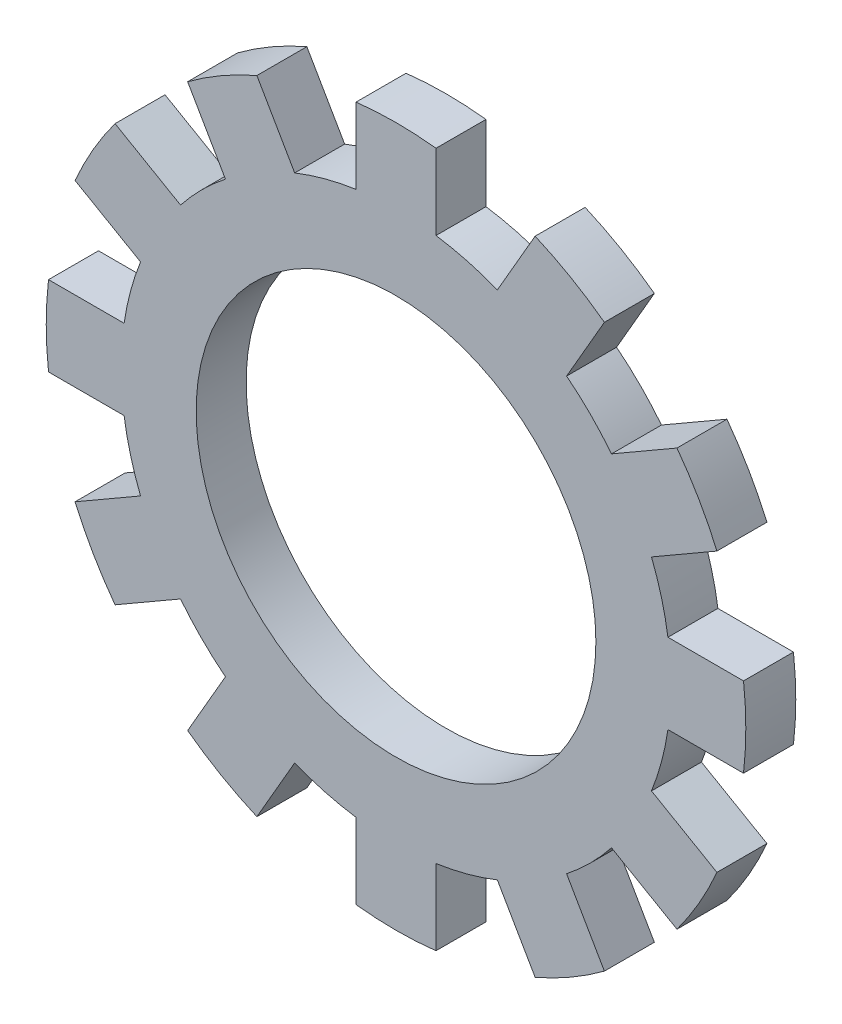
ISO-10303-21;
HEADER;
FILE_DESCRIPTION(('STEP AP214'),'2;1');
FILE_NAME('part.step','',(''),(''),'','','');
FILE_SCHEMA(('AUTOMOTIVE_DESIGN { 1 0 10303 214 1 1 1 1 }'));
ENDSEC;
DATA;
#1=APPLICATION_CONTEXT('core data for automotive mechanical design processes');
#2=APPLICATION_PROTOCOL_DEFINITION('international standard','automotive_design',2000,#1);
#3=PRODUCT_CONTEXT('',#1,'mechanical');
#4=PRODUCT('Part','Part','',(#3));
#5=PRODUCT_RELATED_PRODUCT_CATEGORY('part','',(#4));
#6=PRODUCT_DEFINITION_FORMATION('','',#4);
#7=PRODUCT_DEFINITION_CONTEXT('part definition',#1,'design');
#8=PRODUCT_DEFINITION('design','',#6,#7);
#9=PRODUCT_DEFINITION_SHAPE('','',#8);
#10=(LENGTH_UNIT() NAMED_UNIT(*) SI_UNIT(.MILLI.,.METRE.));
#11=(NAMED_UNIT(*) PLANE_ANGLE_UNIT() SI_UNIT($,.RADIAN.));
#12=(NAMED_UNIT(*) SI_UNIT($,.STERADIAN.) SOLID_ANGLE_UNIT());
#13=UNCERTAINTY_MEASURE_WITH_UNIT(LENGTH_MEASURE(1.E-05),#10,'distance_accuracy_value','');
#14=(GEOMETRIC_REPRESENTATION_CONTEXT(3) GLOBAL_UNCERTAINTY_ASSIGNED_CONTEXT((#13)) GLOBAL_UNIT_ASSIGNED_CONTEXT((#10,
#11,#12)) REPRESENTATION_CONTEXT('',''));
#15=CARTESIAN_POINT('',(0.,0.,0.));
#16=DIRECTION('',(0.,0.,1.));
#17=DIRECTION('',(1.,0.,0.));
#18=AXIS2_PLACEMENT_3D('',#15,#16,#17);
#19=CARTESIAN_POINT('',(0.,0.,0.25));
#20=DIRECTION('',(0.,0.,-1.));
#21=DIRECTION('',(-1.,0.,0.));
#22=AXIS2_PLACEMENT_3D('',#19,#20,#21);
#23=CYLINDRICAL_SURFACE('',#22,2.75);
#24=CARTESIAN_POINT('',(0.,0.,-0.25));
#25=DIRECTION('',(0.,0.,1.));
#26=DIRECTION('',(1.,0.,0.));
#27=AXIS2_PLACEMENT_3D('',#24,#25,#26);
#28=CIRCLE('',#27,2.75);
#29=CARTESIAN_POINT('',(2.15624171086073,1.70678694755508,-0.25));
#30=VERTEX_POINT('',#29);
#31=CARTESIAN_POINT('',(1.70678694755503,2.15624171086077,-0.25));
#32=VERTEX_POINT('',#31);
#33=EDGE_CURVE('E361',#30,#32,#28,.T.);
#34=ORIENTED_EDGE('',*,*,#33,.T.);
#35=DIRECTION('',(0.,0.,-1.));
#36=VECTOR('',#35,1.);
#37=CARTESIAN_POINT('',(1.70678694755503,2.15624171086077,0.25));
#38=LINE('',#37,#36);
#39=CARTESIAN_POINT('',(1.70678694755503,2.15624171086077,0.25));
#40=VERTEX_POINT('',#39);
#41=EDGE_CURVE('E352',#40,#32,#38,.T.);
#42=ORIENTED_EDGE('',*,*,#41,.F.);
#43=CARTESIAN_POINT('',(0.,0.,0.25));
#44=DIRECTION('',(0.,0.,1.));
#45=DIRECTION('',(1.,0.,0.));
#46=AXIS2_PLACEMENT_3D('',#43,#44,#45);
#47=CIRCLE('',#46,2.75);
#48=CARTESIAN_POINT('',(2.15624171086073,1.70678694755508,0.25));
#49=VERTEX_POINT('',#48);
#50=EDGE_CURVE('E64',#49,#40,#47,.T.);
#51=ORIENTED_EDGE('',*,*,#50,.F.);
#52=DIRECTION('',(0.,0.,-1.));
#53=VECTOR('',#52,1.);
#54=CARTESIAN_POINT('',(2.15624171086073,1.70678694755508,0.25));
#55=LINE('',#54,#53);
#56=EDGE_CURVE('E626',#49,#30,#55,.T.);
#57=ORIENTED_EDGE('',*,*,#56,.T.);
#58=EDGE_LOOP('',(#34,#42,#51,#57));
#59=FACE_BOUND('',#58,.T.);
#60=ADVANCED_FACE('F39',(#59),#23,.T.);
#61=DIRECTION('',(0.,0.,-1.));
#62=VECTOR('',#61,1.);
#63=CARTESIAN_POINT('',(1.01396662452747,2.55624171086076,0.25));
#64=LINE('',#63,#62);
#65=CARTESIAN_POINT('',(1.01396662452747,2.55624171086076,0.25));
#66=VERTEX_POINT('',#65);
#67=CARTESIAN_POINT('',(1.01396662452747,2.55624171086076,-0.25));
#68=VERTEX_POINT('',#67);
#69=EDGE_CURVE('E645',#66,#68,#64,.T.);
#70=ORIENTED_EDGE('',*,*,#69,.T.);
#71=CARTESIAN_POINT('',(0.4,2.72075357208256,-0.25));
#72=VERTEX_POINT('',#71);
#73=EDGE_CURVE('E388',#68,#72,#28,.T.);
#74=ORIENTED_EDGE('',*,*,#73,.T.);
#75=DIRECTION('',(0.,0.,-1.));
#76=VECTOR('',#75,1.);
#77=CARTESIAN_POINT('',(0.4,2.72075357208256,0.25));
#78=LINE('',#77,#76);
#79=CARTESIAN_POINT('',(0.4,2.72075357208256,0.25));
#80=VERTEX_POINT('',#79);
#81=EDGE_CURVE('E405',#80,#72,#78,.T.);
#82=ORIENTED_EDGE('',*,*,#81,.F.);
#83=EDGE_CURVE('E50',#66,#80,#47,.T.);
#84=ORIENTED_EDGE('',*,*,#83,.F.);
#85=EDGE_LOOP('',(#70,#74,#82,#84));
#86=FACE_BOUND('',#85,.T.);
#87=ADVANCED_FACE('F816',(#86),#23,.T.);
#88=CARTESIAN_POINT('',(2.72075357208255,0.400000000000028,-0.25));
#89=VERTEX_POINT('',#88);
#90=CARTESIAN_POINT('',(2.55624171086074,1.01396662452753,-0.25));
#91=VERTEX_POINT('',#90);
#92=EDGE_CURVE('E906',#89,#91,#28,.T.);
#93=ORIENTED_EDGE('',*,*,#92,.T.);
#94=DIRECTION('',(0.,0.,-1.));
#95=VECTOR('',#94,1.);
#96=CARTESIAN_POINT('',(2.55624171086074,1.01396662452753,0.25));
#97=LINE('',#96,#95);
#98=CARTESIAN_POINT('',(2.55624171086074,1.01396662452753,0.25));
#99=VERTEX_POINT('',#98);
#100=EDGE_CURVE('E785',#99,#91,#97,.T.);
#101=ORIENTED_EDGE('',*,*,#100,.F.);
#102=CARTESIAN_POINT('',(2.72075357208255,0.400000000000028,0.25));
#103=VERTEX_POINT('',#102);
#104=EDGE_CURVE('E371',#103,#99,#47,.T.);
#105=ORIENTED_EDGE('',*,*,#104,.F.);
#106=DIRECTION('',(0.,0.,-1.));
#107=VECTOR('',#106,1.);
#108=CARTESIAN_POINT('',(2.72075357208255,0.400000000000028,0.25));
#109=LINE('',#108,#107);
#110=EDGE_CURVE('E604',#103,#89,#109,.T.);
#111=ORIENTED_EDGE('',*,*,#110,.T.);
#112=EDGE_LOOP('',(#93,#101,#105,#111));
#113=FACE_BOUND('',#112,.T.);
#114=ADVANCED_FACE('F904',(#113),#23,.T.);
#115=CARTESIAN_POINT('',(2.55624171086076,-1.01396662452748,-0.25));
#116=VERTEX_POINT('',#115);
#117=CARTESIAN_POINT('',(2.72075357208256,-0.399999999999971,-0.25));
#118=VERTEX_POINT('',#117);
#119=EDGE_CURVE('E887',#116,#118,#28,.T.);
#120=ORIENTED_EDGE('',*,*,#119,.T.);
#121=DIRECTION('',(0.,0.,-1.));
#122=VECTOR('',#121,1.);
#123=CARTESIAN_POINT('',(2.72075357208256,-0.399999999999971,0.25));
#124=LINE('',#123,#122);
#125=CARTESIAN_POINT('',(2.72075357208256,-0.399999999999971,0.25));
#126=VERTEX_POINT('',#125);
#127=EDGE_CURVE('E771',#126,#118,#124,.T.);
#128=ORIENTED_EDGE('',*,*,#127,.F.);
#129=CARTESIAN_POINT('',(2.55624171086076,-1.01396662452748,0.25));
#130=VERTEX_POINT('',#129);
#131=EDGE_CURVE('E376',#130,#126,#47,.T.);
#132=ORIENTED_EDGE('',*,*,#131,.F.);
#133=DIRECTION('',(0.,0.,-1.));
#134=VECTOR('',#133,1.);
#135=CARTESIAN_POINT('',(2.55624171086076,-1.01396662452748,0.25));
#136=LINE('',#135,#134);
#137=EDGE_CURVE('E582',#130,#116,#136,.T.);
#138=ORIENTED_EDGE('',*,*,#137,.T.);
#139=EDGE_LOOP('',(#120,#128,#132,#138));
#140=FACE_BOUND('',#139,.T.);
#141=ADVANCED_FACE('F886',(#140),#23,.T.);
#142=CARTESIAN_POINT('',(1.70678694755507,-2.15624171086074,-0.25));
#143=VERTEX_POINT('',#142);
#144=CARTESIAN_POINT('',(2.15624171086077,-1.70678694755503,-0.25));
#145=VERTEX_POINT('',#144);
#146=EDGE_CURVE('E966',#143,#145,#28,.T.);
#147=ORIENTED_EDGE('',*,*,#146,.T.);
#148=DIRECTION('',(0.,0.,-1.));
#149=VECTOR('',#148,1.);
#150=CARTESIAN_POINT('',(2.15624171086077,-1.70678694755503,0.25));
#151=LINE('',#150,#149);
#152=CARTESIAN_POINT('',(2.15624171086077,-1.70678694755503,0.25));
#153=VERTEX_POINT('',#152);
#154=EDGE_CURVE('E757',#153,#145,#151,.T.);
#155=ORIENTED_EDGE('',*,*,#154,.F.);
#156=CARTESIAN_POINT('',(1.70678694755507,-2.15624171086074,0.25));
#157=VERTEX_POINT('',#156);
#158=EDGE_CURVE('E872',#157,#153,#47,.T.);
#159=ORIENTED_EDGE('',*,*,#158,.F.);
#160=DIRECTION('',(0.,0.,-1.));
#161=VECTOR('',#160,1.);
#162=CARTESIAN_POINT('',(1.70678694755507,-2.15624171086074,0.25));
#163=LINE('',#162,#161);
#164=EDGE_CURVE('E560',#157,#143,#163,.T.);
#165=ORIENTED_EDGE('',*,*,#164,.T.);
#166=EDGE_LOOP('',(#147,#155,#159,#165));
#167=FACE_BOUND('',#166,.T.);
#168=ADVANCED_FACE('F974',(#167),#23,.T.);
#169=CARTESIAN_POINT('',(0.4,-2.72075357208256,-0.25));
#170=VERTEX_POINT('',#169);
#171=CARTESIAN_POINT('',(1.01396662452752,-2.55624171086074,-0.25));
#172=VERTEX_POINT('',#171);
#173=EDGE_CURVE('E961',#170,#172,#28,.T.);
#174=ORIENTED_EDGE('',*,*,#173,.T.);
#175=DIRECTION('',(0.,0.,-1.));
#176=VECTOR('',#175,1.);
#177=CARTESIAN_POINT('',(1.01396662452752,-2.55624171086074,0.25));
#178=LINE('',#177,#176);
#179=CARTESIAN_POINT('',(1.01396662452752,-2.55624171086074,0.25));
#180=VERTEX_POINT('',#179);
#181=EDGE_CURVE('E743',#180,#172,#178,.T.);
#182=ORIENTED_EDGE('',*,*,#181,.F.);
#183=CARTESIAN_POINT('',(0.4,-2.72075357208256,0.25));
#184=VERTEX_POINT('',#183);
#185=EDGE_CURVE('E868',#184,#180,#47,.T.);
#186=ORIENTED_EDGE('',*,*,#185,.F.);
#187=DIRECTION('',(0.,0.,-1.));
#188=VECTOR('',#187,1.);
#189=CARTESIAN_POINT('',(0.4,-2.72075357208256,0.25));
#190=LINE('',#189,#188);
#191=EDGE_CURVE('E538',#184,#170,#190,.T.);
#192=ORIENTED_EDGE('',*,*,#191,.T.);
#193=EDGE_LOOP('',(#174,#182,#186,#192));
#194=FACE_BOUND('',#193,.T.);
#195=ADVANCED_FACE('F1402',(#194),#23,.T.);
#196=CARTESIAN_POINT('',(-1.01396662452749,-2.55624171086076,-0.25));
#197=VERTEX_POINT('',#196);
#198=CARTESIAN_POINT('',(-0.4,-2.72075357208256,-0.25));
#199=VERTEX_POINT('',#198);
#200=EDGE_CURVE('E956',#197,#199,#28,.T.);
#201=ORIENTED_EDGE('',*,*,#200,.T.);
#202=DIRECTION('',(0.,0.,-1.));
#203=VECTOR('',#202,1.);
#204=CARTESIAN_POINT('',(-0.4,-2.72075357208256,0.25));
#205=LINE('',#204,#203);
#206=CARTESIAN_POINT('',(-0.4,-2.72075357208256,0.25));
#207=VERTEX_POINT('',#206);
#208=EDGE_CURVE('E729',#207,#199,#205,.T.);
#209=ORIENTED_EDGE('',*,*,#208,.F.);
#210=CARTESIAN_POINT('',(-1.01396662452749,-2.55624171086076,0.25));
#211=VERTEX_POINT('',#210);
#212=EDGE_CURVE('E863',#211,#207,#47,.T.);
#213=ORIENTED_EDGE('',*,*,#212,.F.);
#214=DIRECTION('',(0.,0.,-1.));
#215=VECTOR('',#214,1.);
#216=CARTESIAN_POINT('',(-1.01396662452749,-2.55624171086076,0.25));
#217=LINE('',#216,#215);
#218=EDGE_CURVE('E516',#211,#197,#217,.T.);
#219=ORIENTED_EDGE('',*,*,#218,.T.);
#220=EDGE_LOOP('',(#201,#209,#213,#219));
#221=FACE_BOUND('',#220,.T.);
#222=ADVANCED_FACE('F1394',(#221),#23,.T.);
#223=CARTESIAN_POINT('',(-2.15624171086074,-1.70678694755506,-0.25));
#224=VERTEX_POINT('',#223);
#225=CARTESIAN_POINT('',(-1.70678694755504,-2.15624171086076,-0.25));
#226=VERTEX_POINT('',#225);
#227=EDGE_CURVE('E951',#224,#226,#28,.T.);
#228=ORIENTED_EDGE('',*,*,#227,.T.);
#229=DIRECTION('',(0.,0.,-1.));
#230=VECTOR('',#229,1.);
#231=CARTESIAN_POINT('',(-1.70678694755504,-2.15624171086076,0.25));
#232=LINE('',#231,#230);
#233=CARTESIAN_POINT('',(-1.70678694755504,-2.15624171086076,0.25));
#234=VERTEX_POINT('',#233);
#235=EDGE_CURVE('E715',#234,#226,#232,.T.);
#236=ORIENTED_EDGE('',*,*,#235,.F.);
#237=CARTESIAN_POINT('',(-2.15624171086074,-1.70678694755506,0.25));
#238=VERTEX_POINT('',#237);
#239=EDGE_CURVE('E859',#238,#234,#47,.T.);
#240=ORIENTED_EDGE('',*,*,#239,.F.);
#241=DIRECTION('',(0.,0.,-1.));
#242=VECTOR('',#241,1.);
#243=CARTESIAN_POINT('',(-2.15624171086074,-1.70678694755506,0.25));
#244=LINE('',#243,#242);
#245=EDGE_CURVE('E494',#238,#224,#244,.T.);
#246=ORIENTED_EDGE('',*,*,#245,.T.);
#247=EDGE_LOOP('',(#228,#236,#240,#246));
#248=FACE_BOUND('',#247,.T.);
#249=ADVANCED_FACE('F1386',(#248),#23,.T.);
#250=CARTESIAN_POINT('',(-2.72075357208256,-0.400000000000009,-0.25));
#251=VERTEX_POINT('',#250);
#252=CARTESIAN_POINT('',(-2.55624171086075,-1.01396662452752,-0.25));
#253=VERTEX_POINT('',#252);
#254=EDGE_CURVE('E947',#251,#253,#28,.T.);
#255=ORIENTED_EDGE('',*,*,#254,.T.);
#256=DIRECTION('',(0.,0.,-1.));
#257=VECTOR('',#256,1.);
#258=CARTESIAN_POINT('',(-2.55624171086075,-1.01396662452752,0.25));
#259=LINE('',#258,#257);
#260=CARTESIAN_POINT('',(-2.55624171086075,-1.01396662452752,0.25));
#261=VERTEX_POINT('',#260);
#262=EDGE_CURVE('E701',#261,#253,#259,.T.);
#263=ORIENTED_EDGE('',*,*,#262,.F.);
#264=CARTESIAN_POINT('',(-2.72075357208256,-0.400000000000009,0.25));
#265=VERTEX_POINT('',#264);
#266=EDGE_CURVE('E854',#265,#261,#47,.T.);
#267=ORIENTED_EDGE('',*,*,#266,.F.);
#268=DIRECTION('',(0.,0.,-1.));
#269=VECTOR('',#268,1.);
#270=CARTESIAN_POINT('',(-2.72075357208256,-0.400000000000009,0.25));
#271=LINE('',#270,#269);
#272=EDGE_CURVE('E473',#265,#251,#271,.T.);
#273=ORIENTED_EDGE('',*,*,#272,.T.);
#274=EDGE_LOOP('',(#255,#263,#267,#273));
#275=FACE_BOUND('',#274,.T.);
#276=ADVANCED_FACE('F939',(#275),#23,.T.);
#277=CARTESIAN_POINT('',(-2.55624171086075,1.0139666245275,-0.25));
#278=VERTEX_POINT('',#277);
#279=CARTESIAN_POINT('',(-2.72075357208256,0.39999999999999,-0.25));
#280=VERTEX_POINT('',#279);
#281=EDGE_CURVE('E943',#278,#280,#28,.T.);
#282=ORIENTED_EDGE('',*,*,#281,.T.);
#283=DIRECTION('',(0.,0.,-1.));
#284=VECTOR('',#283,1.);
#285=CARTESIAN_POINT('',(-2.72075357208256,0.39999999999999,0.25));
#286=LINE('',#285,#284);
#287=CARTESIAN_POINT('',(-2.72075357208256,0.39999999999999,0.25));
#288=VERTEX_POINT('',#287);
#289=EDGE_CURVE('E687',#288,#280,#286,.T.);
#290=ORIENTED_EDGE('',*,*,#289,.F.);
#291=CARTESIAN_POINT('',(-2.55624171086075,1.0139666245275,0.25));
#292=VERTEX_POINT('',#291);
#293=EDGE_CURVE('E851',#292,#288,#47,.T.);
#294=ORIENTED_EDGE('',*,*,#293,.F.);
#295=DIRECTION('',(0.,0.,-1.));
#296=VECTOR('',#295,1.);
#297=CARTESIAN_POINT('',(-2.55624171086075,1.0139666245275,0.25));
#298=LINE('',#297,#296);
#299=EDGE_CURVE('E451',#292,#278,#298,.T.);
#300=ORIENTED_EDGE('',*,*,#299,.T.);
#301=EDGE_LOOP('',(#282,#290,#294,#300));
#302=FACE_BOUND('',#301,.T.);
#303=ADVANCED_FACE('F935',(#302),#23,.T.);
#304=CARTESIAN_POINT('',(-1.70678694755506,2.15624171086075,-0.25));
#305=VERTEX_POINT('',#304);
#306=CARTESIAN_POINT('',(-2.15624171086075,1.70678694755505,-0.25));
#307=VERTEX_POINT('',#306);
#308=EDGE_CURVE('E942',#305,#307,#28,.T.);
#309=ORIENTED_EDGE('',*,*,#308,.T.);
#310=DIRECTION('',(0.,0.,-1.));
#311=VECTOR('',#310,1.);
#312=CARTESIAN_POINT('',(-2.15624171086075,1.70678694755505,0.25));
#313=LINE('',#312,#311);
#314=CARTESIAN_POINT('',(-2.15624171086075,1.70678694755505,0.25));
#315=VERTEX_POINT('',#314);
#316=EDGE_CURVE('E673',#315,#307,#313,.T.);
#317=ORIENTED_EDGE('',*,*,#316,.F.);
#318=CARTESIAN_POINT('',(-1.70678694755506,2.15624171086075,0.25));
#319=VERTEX_POINT('',#318);
#320=EDGE_CURVE('E49',#319,#315,#47,.T.);
#321=ORIENTED_EDGE('',*,*,#320,.F.);
#322=DIRECTION('',(0.,0.,-1.));
#323=VECTOR('',#322,1.);
#324=CARTESIAN_POINT('',(-1.70678694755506,2.15624171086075,0.25));
#325=LINE('',#324,#323);
#326=EDGE_CURVE('E429',#319,#305,#325,.T.);
#327=ORIENTED_EDGE('',*,*,#326,.T.);
#328=EDGE_LOOP('',(#309,#317,#321,#327));
#329=FACE_BOUND('',#328,.T.);
#330=ADVANCED_FACE('F929',(#329),#23,.T.);
#331=CARTESIAN_POINT('',(-0.4,2.72075357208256,-0.25));
#332=VERTEX_POINT('',#331);
#333=CARTESIAN_POINT('',(-1.01396662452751,2.55624171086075,-0.25));
#334=VERTEX_POINT('',#333);
#335=EDGE_CURVE('E43',#332,#334,#28,.T.);
#336=ORIENTED_EDGE('',*,*,#335,.T.);
#337=DIRECTION('',(0.,0.,-1.));
#338=VECTOR('',#337,1.);
#339=CARTESIAN_POINT('',(-1.01396662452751,2.55624171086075,0.25));
#340=LINE('',#339,#338);
#341=CARTESIAN_POINT('',(-1.01396662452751,2.55624171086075,0.25));
#342=VERTEX_POINT('',#341);
#343=EDGE_CURVE('E657',#342,#334,#340,.T.);
#344=ORIENTED_EDGE('',*,*,#343,.F.);
#345=CARTESIAN_POINT('',(-0.4,2.72075357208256,0.25));
#346=VERTEX_POINT('',#345);
#347=EDGE_CURVE('E11',#346,#342,#47,.T.);
#348=ORIENTED_EDGE('',*,*,#347,.F.);
#349=DIRECTION('',(0.,0.,-1.));
#350=VECTOR('',#349,1.);
#351=CARTESIAN_POINT('',(-0.4,2.72075357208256,0.25));
#352=LINE('',#351,#350);
#353=EDGE_CURVE('E392',#346,#332,#352,.T.);
#354=ORIENTED_EDGE('',*,*,#353,.T.);
#355=EDGE_LOOP('',(#336,#344,#348,#354));
#356=FACE_BOUND('',#355,.T.);
#357=ADVANCED_FACE('F41',(#356),#23,.T.);
#358=CARTESIAN_POINT('',(0.,0.,0.25));
#359=DIRECTION('',(0.,0.,1.));
#360=DIRECTION('',(1.,0.,0.));
#361=AXIS2_PLACEMENT_3D('',#358,#359,#360);
#362=PLANE('',#361);
#363=ORIENTED_EDGE('',*,*,#347,.T.);
#364=DIRECTION('',(0.500000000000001,-0.866025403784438,0.));
#365=VECTOR('',#364,1.);
#366=CARTESIAN_POINT('',(-1.3921237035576,3.21122898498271,0.25));
#367=LINE('',#366,#365);
#368=CARTESIAN_POINT('',(-1.3921237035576,3.21122898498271,0.25));
#369=VERTEX_POINT('',#368);
#370=EDGE_CURVE('E668',#369,#342,#367,.T.);
#371=ORIENTED_EDGE('',*,*,#370,.F.);
#372=CARTESIAN_POINT('',(0.,0.,0.25));
#373=DIRECTION('',(0.,0.,1.));
#374=DIRECTION('',(0.866025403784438,0.500000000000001,0.));
#375=AXIS2_PLACEMENT_3D('',#372,#373,#374);
#376=CIRCLE('',#375,3.5);
#377=CARTESIAN_POINT('',(-2.08494402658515,2.81122898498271,0.25));
#378=VERTEX_POINT('',#377);
#379=EDGE_CURVE('E438',#369,#378,#376,.T.);
#380=ORIENTED_EDGE('',*,*,#379,.T.);
#381=DIRECTION('',(0.500000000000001,-0.866025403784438,0.));
#382=VECTOR('',#381,1.);
#383=CARTESIAN_POINT('',(-2.08494402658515,2.81122898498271,0.25));
#384=LINE('',#383,#382);
#385=EDGE_CURVE('E433',#378,#319,#384,.T.);
#386=ORIENTED_EDGE('',*,*,#385,.T.);
#387=ORIENTED_EDGE('',*,*,#320,.T.);
#388=DIRECTION('',(0.86602540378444,-0.499999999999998,0.));
#389=VECTOR('',#388,1.);
#390=CARTESIAN_POINT('',(-2.81122898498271,2.08494402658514,0.25));
#391=LINE('',#390,#389);
#392=CARTESIAN_POINT('',(-2.81122898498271,2.08494402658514,0.25));
#393=VERTEX_POINT('',#392);
#394=EDGE_CURVE('E682',#393,#315,#391,.T.);
#395=ORIENTED_EDGE('',*,*,#394,.F.);
#396=CARTESIAN_POINT('',(0.,0.,0.25));
#397=DIRECTION('',(0.,0.,1.));
#398=DIRECTION('',(0.499999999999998,0.86602540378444,0.));
#399=AXIS2_PLACEMENT_3D('',#396,#397,#398);
#400=CIRCLE('',#399,3.5);
#401=CARTESIAN_POINT('',(-3.21122898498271,1.39212370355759,0.25));
#402=VERTEX_POINT('',#401);
#403=EDGE_CURVE('E460',#393,#402,#400,.T.);
#404=ORIENTED_EDGE('',*,*,#403,.T.);
#405=DIRECTION('',(0.86602540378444,-0.499999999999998,0.));
#406=VECTOR('',#405,1.);
#407=CARTESIAN_POINT('',(-3.21122898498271,1.39212370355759,0.25));
#408=LINE('',#407,#406);
#409=EDGE_CURVE('E455',#402,#292,#408,.T.);
#410=ORIENTED_EDGE('',*,*,#409,.T.);
#411=ORIENTED_EDGE('',*,*,#293,.T.);
#412=DIRECTION('',(1.,0.,0.));
#413=VECTOR('',#412,1.);
#414=CARTESIAN_POINT('',(-3.47706773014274,0.399999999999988,0.25));
#415=LINE('',#414,#413);
#416=CARTESIAN_POINT('',(-3.47706773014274,0.399999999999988,0.25));
#417=VERTEX_POINT('',#416);
#418=EDGE_CURVE('E696',#417,#288,#415,.T.);
#419=ORIENTED_EDGE('',*,*,#418,.F.);
#420=CARTESIAN_POINT('',(0.,0.,0.25));
#421=DIRECTION('',(0.,0.,1.));
#422=DIRECTION('',(0.,1.,0.));
#423=AXIS2_PLACEMENT_3D('',#420,#421,#422);
#424=CIRCLE('',#423,3.5);
#425=CARTESIAN_POINT('',(-3.47706773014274,-0.400000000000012,0.25));
#426=VERTEX_POINT('',#425);
#427=EDGE_CURVE('E482',#417,#426,#424,.T.);
#428=ORIENTED_EDGE('',*,*,#427,.T.);
#429=DIRECTION('',(1.,0.,0.));
#430=VECTOR('',#429,1.);
#431=CARTESIAN_POINT('',(-3.47706773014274,-0.400000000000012,0.25));
#432=LINE('',#431,#430);
#433=EDGE_CURVE('E477',#426,#265,#432,.T.);
#434=ORIENTED_EDGE('',*,*,#433,.T.);
#435=ORIENTED_EDGE('',*,*,#266,.T.);
#436=DIRECTION('',(0.866025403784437,0.500000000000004,0.));
#437=VECTOR('',#436,1.);
#438=CARTESIAN_POINT('',(-3.2112289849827,-1.39212370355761,0.25));
#439=LINE('',#438,#437);
#440=CARTESIAN_POINT('',(-3.2112289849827,-1.39212370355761,0.25));
#441=VERTEX_POINT('',#440);
#442=EDGE_CURVE('E710',#441,#261,#439,.T.);
#443=ORIENTED_EDGE('',*,*,#442,.F.);
#444=CARTESIAN_POINT('',(0.,0.,0.25));
#445=DIRECTION('',(0.,0.,1.));
#446=DIRECTION('',(-0.500000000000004,0.866025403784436,0.));
#447=AXIS2_PLACEMENT_3D('',#444,#445,#446);
#448=CIRCLE('',#447,3.5);
#449=CARTESIAN_POINT('',(-2.8112289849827,-2.08494402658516,0.25));
#450=VERTEX_POINT('',#449);
#451=EDGE_CURVE('E503',#441,#450,#448,.T.);
#452=ORIENTED_EDGE('',*,*,#451,.T.);
#453=DIRECTION('',(0.866025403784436,0.500000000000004,0.));
#454=VECTOR('',#453,1.);
#455=CARTESIAN_POINT('',(-2.8112289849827,-2.08494402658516,0.25));
#456=LINE('',#455,#454);
#457=EDGE_CURVE('E498',#450,#238,#456,.T.);
#458=ORIENTED_EDGE('',*,*,#457,.T.);
#459=ORIENTED_EDGE('',*,*,#239,.T.);
#460=DIRECTION('',(0.499999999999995,0.866025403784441,0.));
#461=VECTOR('',#460,1.);
#462=CARTESIAN_POINT('',(-2.08494402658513,-2.81122898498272,0.25));
#463=LINE('',#462,#461);
#464=CARTESIAN_POINT('',(-2.08494402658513,-2.81122898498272,0.25));
#465=VERTEX_POINT('',#464);
#466=EDGE_CURVE('E724',#465,#234,#463,.T.);
#467=ORIENTED_EDGE('',*,*,#466,.F.);
#468=CARTESIAN_POINT('',(0.,0.,0.25));
#469=DIRECTION('',(0.,0.,1.));
#470=DIRECTION('',(-0.866025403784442,0.499999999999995,0.));
#471=AXIS2_PLACEMENT_3D('',#468,#469,#470);
#472=CIRCLE('',#471,3.5);
#473=CARTESIAN_POINT('',(-1.39212370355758,-3.21122898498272,0.25));
#474=VERTEX_POINT('',#473);
#475=EDGE_CURVE('E525',#465,#474,#472,.T.);
#476=ORIENTED_EDGE('',*,*,#475,.T.);
#477=DIRECTION('',(0.499999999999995,0.866025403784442,0.));
#478=VECTOR('',#477,1.);
#479=CARTESIAN_POINT('',(-1.39212370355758,-3.21122898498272,0.25));
#480=LINE('',#479,#478);
#481=EDGE_CURVE('E520',#474,#211,#480,.T.);
#482=ORIENTED_EDGE('',*,*,#481,.T.);
#483=ORIENTED_EDGE('',*,*,#212,.T.);
#484=DIRECTION('',(0.,1.,0.));
#485=VECTOR('',#484,1.);
#486=CARTESIAN_POINT('',(-0.4,-3.47706773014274,0.25));
#487=LINE('',#486,#485);
#488=CARTESIAN_POINT('',(-0.4,-3.47706773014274,0.25));
#489=VERTEX_POINT('',#488);
#490=EDGE_CURVE('E738',#489,#207,#487,.T.);
#491=ORIENTED_EDGE('',*,*,#490,.F.);
#492=CARTESIAN_POINT('',(0.,0.,0.25));
#493=DIRECTION('',(0.,0.,1.));
#494=DIRECTION('',(-1.,0.,0.));
#495=AXIS2_PLACEMENT_3D('',#492,#493,#494);
#496=CIRCLE('',#495,3.5);
#497=CARTESIAN_POINT('',(0.4,-3.47706773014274,0.25));
#498=VERTEX_POINT('',#497);
#499=EDGE_CURVE('E547',#489,#498,#496,.T.);
#500=ORIENTED_EDGE('',*,*,#499,.T.);
#501=DIRECTION('',(0.,1.,0.));
#502=VECTOR('',#501,1.);
#503=CARTESIAN_POINT('',(0.4,-3.47706773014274,0.25));
#504=LINE('',#503,#502);
#505=EDGE_CURVE('E542',#498,#184,#504,.T.);
#506=ORIENTED_EDGE('',*,*,#505,.T.);
#507=ORIENTED_EDGE('',*,*,#185,.T.);
#508=DIRECTION('',(-0.500000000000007,0.866025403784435,0.));
#509=VECTOR('',#508,1.);
#510=CARTESIAN_POINT('',(1.39212370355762,-3.2112289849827,0.25));
#511=LINE('',#510,#509);
#512=CARTESIAN_POINT('',(1.39212370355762,-3.2112289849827,0.25));
#513=VERTEX_POINT('',#512);
#514=EDGE_CURVE('E752',#513,#180,#511,.T.);
#515=ORIENTED_EDGE('',*,*,#514,.F.);
#516=CARTESIAN_POINT('',(0.,0.,0.25));
#517=DIRECTION('',(0.,0.,1.));
#518=DIRECTION('',(-0.866025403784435,-0.500000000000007,0.));
#519=AXIS2_PLACEMENT_3D('',#516,#517,#518);
#520=CIRCLE('',#519,3.5);
#521=CARTESIAN_POINT('',(2.08494402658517,-2.81122898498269,0.25));
#522=VERTEX_POINT('',#521);
#523=EDGE_CURVE('E569',#513,#522,#520,.T.);
#524=ORIENTED_EDGE('',*,*,#523,.T.);
#525=DIRECTION('',(-0.500000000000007,0.866025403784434,0.));
#526=VECTOR('',#525,1.);
#527=CARTESIAN_POINT('',(2.08494402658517,-2.81122898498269,0.25));
#528=LINE('',#527,#526);
#529=EDGE_CURVE('E564',#522,#157,#528,.T.);
#530=ORIENTED_EDGE('',*,*,#529,.T.);
#531=ORIENTED_EDGE('',*,*,#158,.T.);
#532=DIRECTION('',(-0.866025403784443,0.499999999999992,0.));
#533=VECTOR('',#532,1.);
#534=CARTESIAN_POINT('',(2.81122898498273,-2.08494402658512,0.25));
#535=LINE('',#534,#533);
#536=CARTESIAN_POINT('',(2.81122898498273,-2.08494402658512,0.25));
#537=VERTEX_POINT('',#536);
#538=EDGE_CURVE('E766',#537,#153,#535,.T.);
#539=ORIENTED_EDGE('',*,*,#538,.F.);
#540=CARTESIAN_POINT('',(0.,0.,0.25));
#541=DIRECTION('',(0.,0.,1.));
#542=DIRECTION('',(-0.499999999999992,-0.866025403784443,0.));
#543=AXIS2_PLACEMENT_3D('',#540,#541,#542);
#544=CIRCLE('',#543,3.5);
#545=CARTESIAN_POINT('',(3.21122898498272,-1.39212370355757,0.25));
#546=VERTEX_POINT('',#545);
#547=EDGE_CURVE('E591',#537,#546,#544,.T.);
#548=ORIENTED_EDGE('',*,*,#547,.T.);
#549=DIRECTION('',(-0.866025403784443,0.499999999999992,0.));
#550=VECTOR('',#549,1.);
#551=CARTESIAN_POINT('',(3.21122898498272,-1.39212370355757,0.25));
#552=LINE('',#551,#550);
#553=EDGE_CURVE('E586',#546,#130,#552,.T.);
#554=ORIENTED_EDGE('',*,*,#553,.T.);
#555=ORIENTED_EDGE('',*,*,#131,.T.);
#556=DIRECTION('',(-1.,0.,0.));
#557=VECTOR('',#556,1.);
#558=CARTESIAN_POINT('',(3.47706773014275,-0.399999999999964,0.25));
#559=LINE('',#558,#557);
#560=CARTESIAN_POINT('',(3.47706773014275,-0.399999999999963,0.25));
#561=VERTEX_POINT('',#560);
#562=EDGE_CURVE('E780',#561,#126,#559,.T.);
#563=ORIENTED_EDGE('',*,*,#562,.F.);
#564=CARTESIAN_POINT('',(0.,0.,0.25));
#565=DIRECTION('',(0.,0.,1.));
#566=DIRECTION('',(0.,-1.,0.));
#567=AXIS2_PLACEMENT_3D('',#564,#565,#566);
#568=CIRCLE('',#567,3.5);
#569=CARTESIAN_POINT('',(3.47706773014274,0.400000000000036,0.25));
#570=VERTEX_POINT('',#569);
#571=EDGE_CURVE('E613',#561,#570,#568,.T.);
#572=ORIENTED_EDGE('',*,*,#571,.T.);
#573=DIRECTION('',(-1.,0.,0.));
#574=VECTOR('',#573,1.);
#575=CARTESIAN_POINT('',(3.47706773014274,0.400000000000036,0.25));
#576=LINE('',#575,#574);
#577=EDGE_CURVE('E608',#570,#103,#576,.T.);
#578=ORIENTED_EDGE('',*,*,#577,.T.);
#579=ORIENTED_EDGE('',*,*,#104,.T.);
#580=DIRECTION('',(-0.866025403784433,-0.50000000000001,0.));
#581=VECTOR('',#580,1.);
#582=CARTESIAN_POINT('',(3.21122898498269,1.39212370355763,0.25));
#583=LINE('',#582,#581);
#584=CARTESIAN_POINT('',(3.21122898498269,1.39212370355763,0.25));
#585=VERTEX_POINT('',#584);
#586=EDGE_CURVE('E794',#585,#99,#583,.T.);
#587=ORIENTED_EDGE('',*,*,#586,.F.);
#588=CARTESIAN_POINT('',(0.,0.,0.25));
#589=DIRECTION('',(0.,0.,1.));
#590=DIRECTION('',(0.50000000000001,-0.866025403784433,0.));
#591=AXIS2_PLACEMENT_3D('',#588,#589,#590);
#592=CIRCLE('',#591,3.5);
#593=CARTESIAN_POINT('',(2.81122898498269,2.08494402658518,0.25));
#594=VERTEX_POINT('',#593);
#595=EDGE_CURVE('E633',#585,#594,#592,.T.);
#596=ORIENTED_EDGE('',*,*,#595,.T.);
#597=DIRECTION('',(-0.866025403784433,-0.50000000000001,0.));
#598=VECTOR('',#597,1.);
#599=CARTESIAN_POINT('',(2.81122898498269,2.08494402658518,0.25));
#600=LINE('',#599,#598);
#601=EDGE_CURVE('E368',#594,#49,#600,.T.);
#602=ORIENTED_EDGE('',*,*,#601,.T.);
#603=ORIENTED_EDGE('',*,*,#50,.T.);
#604=DIRECTION('',(-0.499999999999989,-0.866025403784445,0.));
#605=VECTOR('',#604,1.);
#606=CARTESIAN_POINT('',(2.08494402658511,2.81122898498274,0.25));
#607=LINE('',#606,#605);
#608=CARTESIAN_POINT('',(2.08494402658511,2.81122898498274,0.25));
#609=VERTEX_POINT('',#608);
#610=EDGE_CURVE('E349',#609,#40,#607,.T.);
#611=ORIENTED_EDGE('',*,*,#610,.F.);
#612=CARTESIAN_POINT('',(0.,0.,0.25));
#613=DIRECTION('',(0.,0.,1.));
#614=DIRECTION('',(0.866025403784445,-0.499999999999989,0.));
#615=AXIS2_PLACEMENT_3D('',#612,#613,#614);
#616=CIRCLE('',#615,3.5);
#617=CARTESIAN_POINT('',(1.39212370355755,3.21122898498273,0.25));
#618=VERTEX_POINT('',#617);
#619=EDGE_CURVE('E653',#609,#618,#616,.T.);
#620=ORIENTED_EDGE('',*,*,#619,.T.);
#621=DIRECTION('',(-0.499999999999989,-0.866025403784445,0.));
#622=VECTOR('',#621,1.);
#623=CARTESIAN_POINT('',(1.39212370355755,3.21122898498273,0.25));
#624=LINE('',#623,#622);
#625=EDGE_CURVE('E648',#618,#66,#624,.T.);
#626=ORIENTED_EDGE('',*,*,#625,.T.);
#627=ORIENTED_EDGE('',*,*,#83,.T.);
#628=DIRECTION('',(0.,-1.,0.));
#629=VECTOR('',#628,1.);
#630=CARTESIAN_POINT('',(0.4,3.47706773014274,0.25));
#631=LINE('',#630,#629);
#632=CARTESIAN_POINT('',(0.4,3.47706773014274,0.25));
#633=VERTEX_POINT('',#632);
#634=EDGE_CURVE('E417',#633,#80,#631,.T.);
#635=ORIENTED_EDGE('',*,*,#634,.F.);
#636=CARTESIAN_POINT('',(0.,0.,0.25));
#637=DIRECTION('',(0.,0.,1.));
#638=DIRECTION('',(1.,0.,0.));
#639=AXIS2_PLACEMENT_3D('',#636,#637,#638);
#640=CIRCLE('',#639,3.5);
#641=CARTESIAN_POINT('',(-0.4,3.47706773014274,0.25));
#642=VERTEX_POINT('',#641);
#643=EDGE_CURVE('E401',#633,#642,#640,.T.);
#644=ORIENTED_EDGE('',*,*,#643,.T.);
#645=DIRECTION('',(0.,-1.,0.));
#646=VECTOR('',#645,1.);
#647=CARTESIAN_POINT('',(-0.4,3.47706773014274,0.25));
#648=LINE('',#647,#646);
#649=EDGE_CURVE('E396',#642,#346,#648,.T.);
#650=ORIENTED_EDGE('',*,*,#649,.T.);
#651=EDGE_LOOP('',(#363,#371,#380,#386,#387,#395,#404,#410,#411,#419,#428,#434,#435,#443,#452,
#458,#459,#467,#476,#482,#483,#491,#500,#506,#507,#515,#524,#530,#531,#539,#548,#554,#555,#563,
#572,#578,#579,#587,#596,#602,#603,#611,#620,#626,#627,#635,#644,#650));
#652=FACE_BOUND('',#651,.T.);
#653=CARTESIAN_POINT('',(0.,0.,0.25));
#654=DIRECTION('',(0.,0.,1.));
#655=DIRECTION('',(1.,0.,0.));
#656=AXIS2_PLACEMENT_3D('',#653,#654,#655);
#657=CIRCLE('',#656,2.);
#658=CARTESIAN_POINT('',(2.,0.,0.25));
#659=VERTEX_POINT('',#658);
#660=EDGE_CURVE('E383',#659,#659,#657,.T.);
#661=ORIENTED_EDGE('',*,*,#660,.F.);
#662=EDGE_LOOP('',(#661));
#663=FACE_BOUND('',#662,.T.);
#664=ADVANCED_FACE('F365',(#652,#663),#362,.T.);
#665=CARTESIAN_POINT('',(0.,0.,-0.25));
#666=DIRECTION('',(0.,0.,1.));
#667=DIRECTION('',(1.,0.,0.));
#668=AXIS2_PLACEMENT_3D('',#665,#666,#667);
#669=PLANE('',#668);
#670=ORIENTED_EDGE('',*,*,#335,.F.);
#671=DIRECTION('',(0.,-1.,0.));
#672=VECTOR('',#671,1.);
#673=CARTESIAN_POINT('',(-0.4,3.47706773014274,-0.25));
#674=LINE('',#673,#672);
#675=CARTESIAN_POINT('',(-0.4,3.47706773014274,-0.25));
#676=VERTEX_POINT('',#675);
#677=EDGE_CURVE('E397',#676,#332,#674,.T.);
#678=ORIENTED_EDGE('',*,*,#677,.F.);
#679=CARTESIAN_POINT('',(0.,0.,-0.25));
#680=DIRECTION('',(0.,0.,1.));
#681=DIRECTION('',(1.,0.,0.));
#682=AXIS2_PLACEMENT_3D('',#679,#680,#681);
#683=CIRCLE('',#682,3.5);
#684=CARTESIAN_POINT('',(0.4,3.47706773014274,-0.25));
#685=VERTEX_POINT('',#684);
#686=EDGE_CURVE('E402',#685,#676,#683,.T.);
#687=ORIENTED_EDGE('',*,*,#686,.F.);
#688=DIRECTION('',(0.,-1.,0.));
#689=VECTOR('',#688,1.);
#690=CARTESIAN_POINT('',(0.4,3.47706773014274,-0.25));
#691=LINE('',#690,#689);
#692=EDGE_CURVE('E418',#685,#72,#691,.T.);
#693=ORIENTED_EDGE('',*,*,#692,.T.);
#694=ORIENTED_EDGE('',*,*,#73,.F.);
#695=DIRECTION('',(-0.499999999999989,-0.866025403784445,0.));
#696=VECTOR('',#695,1.);
#697=CARTESIAN_POINT('',(1.39212370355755,3.21122898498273,-0.25));
#698=LINE('',#697,#696);
#699=CARTESIAN_POINT('',(1.39212370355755,3.21122898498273,-0.25));
#700=VERTEX_POINT('',#699);
#701=EDGE_CURVE('E649',#700,#68,#698,.T.);
#702=ORIENTED_EDGE('',*,*,#701,.F.);
#703=CARTESIAN_POINT('',(0.,0.,-0.25));
#704=DIRECTION('',(0.,0.,1.));
#705=DIRECTION('',(0.866025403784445,-0.499999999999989,0.));
#706=AXIS2_PLACEMENT_3D('',#703,#704,#705);
#707=CIRCLE('',#706,3.5);
#708=CARTESIAN_POINT('',(2.08494402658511,2.81122898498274,-0.25));
#709=VERTEX_POINT('',#708);
#710=EDGE_CURVE('E654',#709,#700,#707,.T.);
#711=ORIENTED_EDGE('',*,*,#710,.F.);
#712=DIRECTION('',(-0.499999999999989,-0.866025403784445,0.));
#713=VECTOR('',#712,1.);
#714=CARTESIAN_POINT('',(2.08494402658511,2.81122898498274,-0.25));
#715=LINE('',#714,#713);
#716=EDGE_CURVE('E358',#709,#32,#715,.T.);
#717=ORIENTED_EDGE('',*,*,#716,.T.);
#718=ORIENTED_EDGE('',*,*,#33,.F.);
#719=DIRECTION('',(-0.866025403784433,-0.50000000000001,0.));
#720=VECTOR('',#719,1.);
#721=CARTESIAN_POINT('',(2.81122898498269,2.08494402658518,-0.25));
#722=LINE('',#721,#720);
#723=CARTESIAN_POINT('',(2.81122898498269,2.08494402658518,-0.25));
#724=VERTEX_POINT('',#723);
#725=EDGE_CURVE('E629',#724,#30,#722,.T.);
#726=ORIENTED_EDGE('',*,*,#725,.F.);
#727=CARTESIAN_POINT('',(0.,0.,-0.25));
#728=DIRECTION('',(0.,0.,1.));
#729=DIRECTION('',(0.50000000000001,-0.866025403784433,0.));
#730=AXIS2_PLACEMENT_3D('',#727,#728,#729);
#731=CIRCLE('',#730,3.5);
#732=CARTESIAN_POINT('',(3.21122898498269,1.39212370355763,-0.25));
#733=VERTEX_POINT('',#732);
#734=EDGE_CURVE('E634',#733,#724,#731,.T.);
#735=ORIENTED_EDGE('',*,*,#734,.F.);
#736=DIRECTION('',(-0.866025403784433,-0.50000000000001,0.));
#737=VECTOR('',#736,1.);
#738=CARTESIAN_POINT('',(3.21122898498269,1.39212370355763,-0.25));
#739=LINE('',#738,#737);
#740=EDGE_CURVE('E363',#733,#91,#739,.T.);
#741=ORIENTED_EDGE('',*,*,#740,.T.);
#742=ORIENTED_EDGE('',*,*,#92,.F.);
#743=DIRECTION('',(-1.,0.,0.));
#744=VECTOR('',#743,1.);
#745=CARTESIAN_POINT('',(3.47706773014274,0.400000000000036,-0.25));
#746=LINE('',#745,#744);
#747=CARTESIAN_POINT('',(3.47706773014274,0.400000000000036,-0.25));
#748=VERTEX_POINT('',#747);
#749=EDGE_CURVE('E609',#748,#89,#746,.T.);
#750=ORIENTED_EDGE('',*,*,#749,.F.);
#751=CARTESIAN_POINT('',(0.,0.,-0.25));
#752=DIRECTION('',(0.,0.,1.));
#753=DIRECTION('',(0.,-1.,0.));
#754=AXIS2_PLACEMENT_3D('',#751,#752,#753);
#755=CIRCLE('',#754,3.5);
#756=CARTESIAN_POINT('',(3.47706773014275,-0.399999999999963,-0.25));
#757=VERTEX_POINT('',#756);
#758=EDGE_CURVE('E614',#757,#748,#755,.T.);
#759=ORIENTED_EDGE('',*,*,#758,.F.);
#760=DIRECTION('',(-1.,0.,0.));
#761=VECTOR('',#760,1.);
#762=CARTESIAN_POINT('',(3.47706773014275,-0.399999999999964,-0.25));
#763=LINE('',#762,#761);
#764=EDGE_CURVE('E781',#757,#118,#763,.T.);
#765=ORIENTED_EDGE('',*,*,#764,.T.);
#766=ORIENTED_EDGE('',*,*,#119,.F.);
#767=DIRECTION('',(-0.866025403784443,0.499999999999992,0.));
#768=VECTOR('',#767,1.);
#769=CARTESIAN_POINT('',(3.21122898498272,-1.39212370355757,-0.25));
#770=LINE('',#769,#768);
#771=CARTESIAN_POINT('',(3.21122898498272,-1.39212370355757,-0.25));
#772=VERTEX_POINT('',#771);
#773=EDGE_CURVE('E587',#772,#116,#770,.T.);
#774=ORIENTED_EDGE('',*,*,#773,.F.);
#775=CARTESIAN_POINT('',(0.,0.,-0.25));
#776=DIRECTION('',(0.,0.,1.));
#777=DIRECTION('',(-0.499999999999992,-0.866025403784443,0.));
#778=AXIS2_PLACEMENT_3D('',#775,#776,#777);
#779=CIRCLE('',#778,3.5);
#780=CARTESIAN_POINT('',(2.81122898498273,-2.08494402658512,-0.25));
#781=VERTEX_POINT('',#780);
#782=EDGE_CURVE('E592',#781,#772,#779,.T.);
#783=ORIENTED_EDGE('',*,*,#782,.F.);
#784=DIRECTION('',(-0.866025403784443,0.499999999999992,0.));
#785=VECTOR('',#784,1.);
#786=CARTESIAN_POINT('',(2.81122898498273,-2.08494402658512,-0.25));
#787=LINE('',#786,#785);
#788=EDGE_CURVE('E767',#781,#145,#787,.T.);
#789=ORIENTED_EDGE('',*,*,#788,.T.);
#790=ORIENTED_EDGE('',*,*,#146,.F.);
#791=DIRECTION('',(-0.500000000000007,0.866025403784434,0.));
#792=VECTOR('',#791,1.);
#793=CARTESIAN_POINT('',(2.08494402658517,-2.81122898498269,-0.25));
#794=LINE('',#793,#792);
#795=CARTESIAN_POINT('',(2.08494402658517,-2.81122898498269,-0.25));
#796=VERTEX_POINT('',#795);
#797=EDGE_CURVE('E565',#796,#143,#794,.T.);
#798=ORIENTED_EDGE('',*,*,#797,.F.);
#799=CARTESIAN_POINT('',(0.,0.,-0.25));
#800=DIRECTION('',(0.,0.,1.));
#801=DIRECTION('',(-0.866025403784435,-0.500000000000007,0.));
#802=AXIS2_PLACEMENT_3D('',#799,#800,#801);
#803=CIRCLE('',#802,3.5);
#804=CARTESIAN_POINT('',(1.39212370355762,-3.2112289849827,-0.25));
#805=VERTEX_POINT('',#804);
#806=EDGE_CURVE('E570',#805,#796,#803,.T.);
#807=ORIENTED_EDGE('',*,*,#806,.F.);
#808=DIRECTION('',(-0.500000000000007,0.866025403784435,0.));
#809=VECTOR('',#808,1.);
#810=CARTESIAN_POINT('',(1.39212370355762,-3.2112289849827,-0.25));
#811=LINE('',#810,#809);
#812=EDGE_CURVE('E753',#805,#172,#811,.T.);
#813=ORIENTED_EDGE('',*,*,#812,.T.);
#814=ORIENTED_EDGE('',*,*,#173,.F.);
#815=DIRECTION('',(0.,1.,0.));
#816=VECTOR('',#815,1.);
#817=CARTESIAN_POINT('',(0.4,-3.47706773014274,-0.25));
#818=LINE('',#817,#816);
#819=CARTESIAN_POINT('',(0.4,-3.47706773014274,-0.25));
#820=VERTEX_POINT('',#819);
#821=EDGE_CURVE('E543',#820,#170,#818,.T.);
#822=ORIENTED_EDGE('',*,*,#821,.F.);
#823=CARTESIAN_POINT('',(0.,0.,-0.25));
#824=DIRECTION('',(0.,0.,1.));
#825=DIRECTION('',(-1.,0.,0.));
#826=AXIS2_PLACEMENT_3D('',#823,#824,#825);
#827=CIRCLE('',#826,3.5);
#828=CARTESIAN_POINT('',(-0.4,-3.47706773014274,-0.25));
#829=VERTEX_POINT('',#828);
#830=EDGE_CURVE('E548',#829,#820,#827,.T.);
#831=ORIENTED_EDGE('',*,*,#830,.F.);
#832=DIRECTION('',(0.,1.,0.));
#833=VECTOR('',#832,1.);
#834=CARTESIAN_POINT('',(-0.4,-3.47706773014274,-0.25));
#835=LINE('',#834,#833);
#836=EDGE_CURVE('E739',#829,#199,#835,.T.);
#837=ORIENTED_EDGE('',*,*,#836,.T.);
#838=ORIENTED_EDGE('',*,*,#200,.F.);
#839=DIRECTION('',(0.499999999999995,0.866025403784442,0.));
#840=VECTOR('',#839,1.);
#841=CARTESIAN_POINT('',(-1.39212370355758,-3.21122898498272,-0.25));
#842=LINE('',#841,#840);
#843=CARTESIAN_POINT('',(-1.39212370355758,-3.21122898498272,-0.25));
#844=VERTEX_POINT('',#843);
#845=EDGE_CURVE('E521',#844,#197,#842,.T.);
#846=ORIENTED_EDGE('',*,*,#845,.F.);
#847=CARTESIAN_POINT('',(0.,0.,-0.25));
#848=DIRECTION('',(0.,0.,1.));
#849=DIRECTION('',(-0.866025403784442,0.499999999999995,0.));
#850=AXIS2_PLACEMENT_3D('',#847,#848,#849);
#851=CIRCLE('',#850,3.5);
#852=CARTESIAN_POINT('',(-2.08494402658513,-2.81122898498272,-0.25));
#853=VERTEX_POINT('',#852);
#854=EDGE_CURVE('E526',#853,#844,#851,.T.);
#855=ORIENTED_EDGE('',*,*,#854,.F.);
#856=DIRECTION('',(0.499999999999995,0.866025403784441,0.));
#857=VECTOR('',#856,1.);
#858=CARTESIAN_POINT('',(-2.08494402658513,-2.81122898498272,-0.25));
#859=LINE('',#858,#857);
#860=EDGE_CURVE('E725',#853,#226,#859,.T.);
#861=ORIENTED_EDGE('',*,*,#860,.T.);
#862=ORIENTED_EDGE('',*,*,#227,.F.);
#863=DIRECTION('',(0.866025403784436,0.500000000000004,0.));
#864=VECTOR('',#863,1.);
#865=CARTESIAN_POINT('',(-2.8112289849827,-2.08494402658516,-0.25));
#866=LINE('',#865,#864);
#867=CARTESIAN_POINT('',(-2.8112289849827,-2.08494402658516,-0.25));
#868=VERTEX_POINT('',#867);
#869=EDGE_CURVE('E499',#868,#224,#866,.T.);
#870=ORIENTED_EDGE('',*,*,#869,.F.);
#871=CARTESIAN_POINT('',(0.,0.,-0.25));
#872=DIRECTION('',(0.,0.,1.));
#873=DIRECTION('',(-0.500000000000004,0.866025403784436,0.));
#874=AXIS2_PLACEMENT_3D('',#871,#872,#873);
#875=CIRCLE('',#874,3.5);
#876=CARTESIAN_POINT('',(-3.2112289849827,-1.39212370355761,-0.25));
#877=VERTEX_POINT('',#876);
#878=EDGE_CURVE('E504',#877,#868,#875,.T.);
#879=ORIENTED_EDGE('',*,*,#878,.F.);
#880=DIRECTION('',(0.866025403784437,0.500000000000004,0.));
#881=VECTOR('',#880,1.);
#882=CARTESIAN_POINT('',(-3.2112289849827,-1.39212370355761,-0.25));
#883=LINE('',#882,#881);
#884=EDGE_CURVE('E711',#877,#253,#883,.T.);
#885=ORIENTED_EDGE('',*,*,#884,.T.);
#886=ORIENTED_EDGE('',*,*,#254,.F.);
#887=DIRECTION('',(1.,0.,0.));
#888=VECTOR('',#887,1.);
#889=CARTESIAN_POINT('',(-3.47706773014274,-0.400000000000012,-0.25));
#890=LINE('',#889,#888);
#891=CARTESIAN_POINT('',(-3.47706773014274,-0.400000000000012,-0.25));
#892=VERTEX_POINT('',#891);
#893=EDGE_CURVE('E478',#892,#251,#890,.T.);
#894=ORIENTED_EDGE('',*,*,#893,.F.);
#895=CARTESIAN_POINT('',(0.,0.,-0.25));
#896=DIRECTION('',(0.,0.,1.));
#897=DIRECTION('',(0.,1.,0.));
#898=AXIS2_PLACEMENT_3D('',#895,#896,#897);
#899=CIRCLE('',#898,3.5);
#900=CARTESIAN_POINT('',(-3.47706773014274,0.399999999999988,-0.25));
#901=VERTEX_POINT('',#900);
#902=EDGE_CURVE('E483',#901,#892,#899,.T.);
#903=ORIENTED_EDGE('',*,*,#902,.F.);
#904=DIRECTION('',(1.,0.,0.));
#905=VECTOR('',#904,1.);
#906=CARTESIAN_POINT('',(-3.47706773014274,0.399999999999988,-0.25));
#907=LINE('',#906,#905);
#908=EDGE_CURVE('E697',#901,#280,#907,.T.);
#909=ORIENTED_EDGE('',*,*,#908,.T.);
#910=ORIENTED_EDGE('',*,*,#281,.F.);
#911=DIRECTION('',(0.86602540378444,-0.499999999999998,0.));
#912=VECTOR('',#911,1.);
#913=CARTESIAN_POINT('',(-3.21122898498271,1.39212370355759,-0.25));
#914=LINE('',#913,#912);
#915=CARTESIAN_POINT('',(-3.21122898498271,1.39212370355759,-0.25));
#916=VERTEX_POINT('',#915);
#917=EDGE_CURVE('E456',#916,#278,#914,.T.);
#918=ORIENTED_EDGE('',*,*,#917,.F.);
#919=CARTESIAN_POINT('',(0.,0.,-0.25));
#920=DIRECTION('',(0.,0.,1.));
#921=DIRECTION('',(0.499999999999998,0.86602540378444,0.));
#922=AXIS2_PLACEMENT_3D('',#919,#920,#921);
#923=CIRCLE('',#922,3.5);
#924=CARTESIAN_POINT('',(-2.81122898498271,2.08494402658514,-0.25));
#925=VERTEX_POINT('',#924);
#926=EDGE_CURVE('E461',#925,#916,#923,.T.);
#927=ORIENTED_EDGE('',*,*,#926,.F.);
#928=DIRECTION('',(0.86602540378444,-0.499999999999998,0.));
#929=VECTOR('',#928,1.);
#930=CARTESIAN_POINT('',(-2.81122898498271,2.08494402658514,-0.25));
#931=LINE('',#930,#929);
#932=EDGE_CURVE('E683',#925,#307,#931,.T.);
#933=ORIENTED_EDGE('',*,*,#932,.T.);
#934=ORIENTED_EDGE('',*,*,#308,.F.);
#935=DIRECTION('',(0.500000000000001,-0.866025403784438,0.));
#936=VECTOR('',#935,1.);
#937=CARTESIAN_POINT('',(-2.08494402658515,2.81122898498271,-0.25));
#938=LINE('',#937,#936);
#939=CARTESIAN_POINT('',(-2.08494402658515,2.81122898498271,-0.25));
#940=VERTEX_POINT('',#939);
#941=EDGE_CURVE('E434',#940,#305,#938,.T.);
#942=ORIENTED_EDGE('',*,*,#941,.F.);
#943=CARTESIAN_POINT('',(0.,0.,-0.25));
#944=DIRECTION('',(0.,0.,1.));
#945=DIRECTION('',(0.866025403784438,0.500000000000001,0.));
#946=AXIS2_PLACEMENT_3D('',#943,#944,#945);
#947=CIRCLE('',#946,3.5);
#948=CARTESIAN_POINT('',(-1.3921237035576,3.21122898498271,-0.25));
#949=VERTEX_POINT('',#948);
#950=EDGE_CURVE('E439',#949,#940,#947,.T.);
#951=ORIENTED_EDGE('',*,*,#950,.F.);
#952=DIRECTION('',(0.500000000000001,-0.866025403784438,0.));
#953=VECTOR('',#952,1.);
#954=CARTESIAN_POINT('',(-1.3921237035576,3.21122898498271,-0.25));
#955=LINE('',#954,#953);
#956=EDGE_CURVE('E669',#949,#334,#955,.T.);
#957=ORIENTED_EDGE('',*,*,#956,.T.);
#958=EDGE_LOOP('',(#670,#678,#687,#693,#694,#702,#711,#717,#718,#726,#735,#741,#742,#750,#759,
#765,#766,#774,#783,#789,#790,#798,#807,#813,#814,#822,#831,#837,#838,#846,#855,#861,#862,#870,
#879,#885,#886,#894,#903,#909,#910,#918,#927,#933,#934,#942,#951,#957));
#959=FACE_BOUND('',#958,.T.);
#960=CARTESIAN_POINT('',(0.,0.,-0.25));
#961=DIRECTION('',(0.,0.,1.));
#962=DIRECTION('',(1.,0.,0.));
#963=AXIS2_PLACEMENT_3D('',#960,#961,#962);
#964=CIRCLE('',#963,2.);
#965=CARTESIAN_POINT('',(2.,0.,-0.25));
#966=VERTEX_POINT('',#965);
#967=EDGE_CURVE('E379',#966,#966,#964,.T.);
#968=ORIENTED_EDGE('',*,*,#967,.T.);
#969=EDGE_LOOP('',(#968));
#970=FACE_BOUND('',#969,.T.);
#971=ADVANCED_FACE('F804',(#959,#970),#669,.F.);
#972=CARTESIAN_POINT('',(0.,0.,0.25));
#973=DIRECTION('',(0.,0.,-1.));
#974=DIRECTION('',(-1.,0.,0.));
#975=AXIS2_PLACEMENT_3D('',#972,#973,#974);
#976=CYLINDRICAL_SURFACE('',#975,2.);
#977=ORIENTED_EDGE('',*,*,#660,.T.);
#978=EDGE_LOOP('',(#977));
#979=FACE_BOUND('',#978,.T.);
#980=ORIENTED_EDGE('',*,*,#967,.F.);
#981=EDGE_LOOP('',(#980));
#982=FACE_BOUND('',#981,.T.);
#983=ADVANCED_FACE('F1054',(#979,#982),#976,.F.);
#984=CARTESIAN_POINT('',(0.,0.,0.25));
#985=DIRECTION('',(0.,0.,-1.));
#986=DIRECTION('',(-1.,0.,0.));
#987=AXIS2_PLACEMENT_3D('',#984,#985,#986);
#988=CYLINDRICAL_SURFACE('',#987,3.5);
#989=ORIENTED_EDGE('',*,*,#686,.T.);
#990=DIRECTION('',(0.,0.,-1.));
#991=VECTOR('',#990,1.);
#992=CARTESIAN_POINT('',(-0.4,3.47706773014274,0.25));
#993=LINE('',#992,#991);
#994=EDGE_CURVE('E384',#642,#676,#993,.T.);
#995=ORIENTED_EDGE('',*,*,#994,.F.);
#996=ORIENTED_EDGE('',*,*,#643,.F.);
#997=DIRECTION('',(0.,0.,-1.));
#998=VECTOR('',#997,1.);
#999=CARTESIAN_POINT('',(0.4,3.47706773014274,0.25));
#1000=LINE('',#999,#998);
#1001=EDGE_CURVE('E413',#633,#685,#1000,.T.);
#1002=ORIENTED_EDGE('',*,*,#1001,.T.);
#1003=EDGE_LOOP('',(#989,#995,#996,#1002));
#1004=FACE_BOUND('',#1003,.T.);
#1005=ADVANCED_FACE('F825',(#1004),#988,.T.);
#1006=CARTESIAN_POINT('',(-0.4,3.47706773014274,0.25));
#1007=DIRECTION('',(1.,0.,0.));
#1008=DIRECTION('',(0.,1.,0.));
#1009=AXIS2_PLACEMENT_3D('',#1006,#1007,#1008);
#1010=PLANE('',#1009);
#1011=ORIENTED_EDGE('',*,*,#677,.T.);
#1012=ORIENTED_EDGE('',*,*,#353,.F.);
#1013=ORIENTED_EDGE('',*,*,#649,.F.);
#1014=ORIENTED_EDGE('',*,*,#994,.T.);
#1015=EDGE_LOOP('',(#1011,#1012,#1013,#1014));
#1016=FACE_BOUND('',#1015,.T.);
#1017=ADVANCED_FACE('F829',(#1016),#1010,.F.);
#1018=CARTESIAN_POINT('',(0.4,3.47706773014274,0.25));
#1019=DIRECTION('',(1.,0.,0.));
#1020=DIRECTION('',(0.,1.,0.));
#1021=AXIS2_PLACEMENT_3D('',#1018,#1019,#1020);
#1022=PLANE('',#1021);
#1023=ORIENTED_EDGE('',*,*,#692,.F.);
#1024=ORIENTED_EDGE('',*,*,#1001,.F.);
#1025=ORIENTED_EDGE('',*,*,#634,.T.);
#1026=ORIENTED_EDGE('',*,*,#81,.T.);
#1027=EDGE_LOOP('',(#1023,#1024,#1025,#1026));
#1028=FACE_BOUND('',#1027,.T.);
#1029=ADVANCED_FACE('F820',(#1028),#1022,.T.);
#1030=CARTESIAN_POINT('',(0.,0.,0.25));
#1031=DIRECTION('',(0.,0.,-1.));
#1032=DIRECTION('',(-1.,0.,0.));
#1033=AXIS2_PLACEMENT_3D('',#1030,#1031,#1032);
#1034=CYLINDRICAL_SURFACE('',#1033,3.5);
#1035=ORIENTED_EDGE('',*,*,#950,.T.);
#1036=DIRECTION('',(0.,0.,-1.));
#1037=VECTOR('',#1036,1.);
#1038=CARTESIAN_POINT('',(-2.08494402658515,2.81122898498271,0.25));
#1039=LINE('',#1038,#1037);
#1040=EDGE_CURVE('E422',#378,#940,#1039,.T.);
#1041=ORIENTED_EDGE('',*,*,#1040,.F.);
#1042=ORIENTED_EDGE('',*,*,#379,.F.);
#1043=DIRECTION('',(0.,0.,-1.));
#1044=VECTOR('',#1043,1.);
#1045=CARTESIAN_POINT('',(-1.3921237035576,3.21122898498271,0.25));
#1046=LINE('',#1045,#1044);
#1047=EDGE_CURVE('E664',#369,#949,#1046,.T.);
#1048=ORIENTED_EDGE('',*,*,#1047,.T.);
#1049=EDGE_LOOP('',(#1035,#1041,#1042,#1048));
#1050=FACE_BOUND('',#1049,.T.);
#1051=ADVANCED_FACE('F840',(#1050),#1034,.T.);
#1052=CARTESIAN_POINT('',(-2.08494402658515,2.81122898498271,0.25));
#1053=DIRECTION('',(0.866025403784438,0.500000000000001,0.));
#1054=DIRECTION('',(-0.500000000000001,0.866025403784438,0.));
#1055=AXIS2_PLACEMENT_3D('',#1052,#1053,#1054);
#1056=PLANE('',#1055);
#1057=ORIENTED_EDGE('',*,*,#941,.T.);
#1058=ORIENTED_EDGE('',*,*,#326,.F.);
#1059=ORIENTED_EDGE('',*,*,#385,.F.);
#1060=ORIENTED_EDGE('',*,*,#1040,.T.);
#1061=EDGE_LOOP('',(#1057,#1058,#1059,#1060));
#1062=FACE_BOUND('',#1061,.T.);
#1063=ADVANCED_FACE('F845',(#1062),#1056,.F.);
#1064=CARTESIAN_POINT('',(0.,0.,0.25));
#1065=DIRECTION('',(0.,0.,-1.));
#1066=DIRECTION('',(-1.,0.,0.));
#1067=AXIS2_PLACEMENT_3D('',#1064,#1065,#1066);
#1068=CYLINDRICAL_SURFACE('',#1067,3.5);
#1069=ORIENTED_EDGE('',*,*,#926,.T.);
#1070=DIRECTION('',(0.,0.,-1.));
#1071=VECTOR('',#1070,1.);
#1072=CARTESIAN_POINT('',(-3.21122898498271,1.39212370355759,0.25));
#1073=LINE('',#1072,#1071);
#1074=EDGE_CURVE('E442',#402,#916,#1073,.T.);
#1075=ORIENTED_EDGE('',*,*,#1074,.F.);
#1076=ORIENTED_EDGE('',*,*,#403,.F.);
#1077=DIRECTION('',(0.,0.,-1.));
#1078=VECTOR('',#1077,1.);
#1079=CARTESIAN_POINT('',(-2.81122898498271,2.08494402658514,0.25));
#1080=LINE('',#1079,#1078);
#1081=EDGE_CURVE('E678',#393,#925,#1080,.T.);
#1082=ORIENTED_EDGE('',*,*,#1081,.T.);
#1083=EDGE_LOOP('',(#1069,#1075,#1076,#1082));
#1084=FACE_BOUND('',#1083,.T.);
#1085=ADVANCED_FACE('F1039',(#1084),#1068,.T.);
#1086=CARTESIAN_POINT('',(-3.21122898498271,1.39212370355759,0.25));
#1087=DIRECTION('',(0.499999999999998,0.86602540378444,0.));
#1088=DIRECTION('',(-0.86602540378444,0.499999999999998,0.));
#1089=AXIS2_PLACEMENT_3D('',#1086,#1087,#1088);
#1090=PLANE('',#1089);
#1091=ORIENTED_EDGE('',*,*,#917,.T.);
#1092=ORIENTED_EDGE('',*,*,#299,.F.);
#1093=ORIENTED_EDGE('',*,*,#409,.F.);
#1094=ORIENTED_EDGE('',*,*,#1074,.T.);
#1095=EDGE_LOOP('',(#1091,#1092,#1093,#1094));
#1096=FACE_BOUND('',#1095,.T.);
#1097=ADVANCED_FACE('F1035',(#1096),#1090,.F.);
#1098=CARTESIAN_POINT('',(0.,0.,0.25));
#1099=DIRECTION('',(0.,0.,-1.));
#1100=DIRECTION('',(-1.,0.,0.));
#1101=AXIS2_PLACEMENT_3D('',#1098,#1099,#1100);
#1102=CYLINDRICAL_SURFACE('',#1101,3.5);
#1103=ORIENTED_EDGE('',*,*,#902,.T.);
#1104=DIRECTION('',(0.,0.,-1.));
#1105=VECTOR('',#1104,1.);
#1106=CARTESIAN_POINT('',(-3.47706773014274,-0.400000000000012,0.25));
#1107=LINE('',#1106,#1105);
#1108=EDGE_CURVE('E464',#426,#892,#1107,.T.);
#1109=ORIENTED_EDGE('',*,*,#1108,.F.);
#1110=ORIENTED_EDGE('',*,*,#427,.F.);
#1111=DIRECTION('',(0.,0.,-1.));
#1112=VECTOR('',#1111,1.);
#1113=CARTESIAN_POINT('',(-3.47706773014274,0.399999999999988,0.25));
#1114=LINE('',#1113,#1112);
#1115=EDGE_CURVE('E692',#417,#901,#1114,.T.);
#1116=ORIENTED_EDGE('',*,*,#1115,.T.);
#1117=EDGE_LOOP('',(#1103,#1109,#1110,#1116));
#1118=FACE_BOUND('',#1117,.T.);
#1119=ADVANCED_FACE('F1031',(#1118),#1102,.T.);
#1120=CARTESIAN_POINT('',(-3.47706773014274,-0.400000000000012,0.25));
#1121=DIRECTION('',(0.,1.,0.));
#1122=DIRECTION('',(-1.,0.,0.));
#1123=AXIS2_PLACEMENT_3D('',#1120,#1121,#1122);
#1124=PLANE('',#1123);
#1125=ORIENTED_EDGE('',*,*,#893,.T.);
#1126=ORIENTED_EDGE('',*,*,#272,.F.);
#1127=ORIENTED_EDGE('',*,*,#433,.F.);
#1128=ORIENTED_EDGE('',*,*,#1108,.T.);
#1129=EDGE_LOOP('',(#1125,#1126,#1127,#1128));
#1130=FACE_BOUND('',#1129,.T.);
#1131=ADVANCED_FACE('F1027',(#1130),#1124,.F.);
#1132=CARTESIAN_POINT('',(0.,0.,0.25));
#1133=DIRECTION('',(0.,0.,-1.));
#1134=DIRECTION('',(-1.,0.,0.));
#1135=AXIS2_PLACEMENT_3D('',#1132,#1133,#1134);
#1136=CYLINDRICAL_SURFACE('',#1135,3.5);
#1137=ORIENTED_EDGE('',*,*,#878,.T.);
#1138=DIRECTION('',(0.,0.,-1.));
#1139=VECTOR('',#1138,1.);
#1140=CARTESIAN_POINT('',(-2.8112289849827,-2.08494402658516,0.25));
#1141=LINE('',#1140,#1139);
#1142=EDGE_CURVE('E486',#450,#868,#1141,.T.);
#1143=ORIENTED_EDGE('',*,*,#1142,.F.);
#1144=ORIENTED_EDGE('',*,*,#451,.F.);
#1145=DIRECTION('',(0.,0.,-1.));
#1146=VECTOR('',#1145,1.);
#1147=CARTESIAN_POINT('',(-3.2112289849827,-1.39212370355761,0.25));
#1148=LINE('',#1147,#1146);
#1149=EDGE_CURVE('E706',#441,#877,#1148,.T.);
#1150=ORIENTED_EDGE('',*,*,#1149,.T.);
#1151=EDGE_LOOP('',(#1137,#1143,#1144,#1150));
#1152=FACE_BOUND('',#1151,.T.);
#1153=ADVANCED_FACE('F1023',(#1152),#1136,.T.);
#1154=CARTESIAN_POINT('',(-2.8112289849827,-2.08494402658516,0.25));
#1155=DIRECTION('',(-0.500000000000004,0.866025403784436,0.));
#1156=DIRECTION('',(-0.866025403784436,-0.500000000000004,0.));
#1157=AXIS2_PLACEMENT_3D('',#1154,#1155,#1156);
#1158=PLANE('',#1157);
#1159=ORIENTED_EDGE('',*,*,#869,.T.);
#1160=ORIENTED_EDGE('',*,*,#245,.F.);
#1161=ORIENTED_EDGE('',*,*,#457,.F.);
#1162=ORIENTED_EDGE('',*,*,#1142,.T.);
#1163=EDGE_LOOP('',(#1159,#1160,#1161,#1162));
#1164=FACE_BOUND('',#1163,.T.);
#1165=ADVANCED_FACE('F1019',(#1164),#1158,.F.);
#1166=CARTESIAN_POINT('',(0.,0.,0.25));
#1167=DIRECTION('',(0.,0.,-1.));
#1168=DIRECTION('',(-1.,0.,0.));
#1169=AXIS2_PLACEMENT_3D('',#1166,#1167,#1168);
#1170=CYLINDRICAL_SURFACE('',#1169,3.5);
#1171=ORIENTED_EDGE('',*,*,#854,.T.);
#1172=DIRECTION('',(0.,0.,-1.));
#1173=VECTOR('',#1172,1.);
#1174=CARTESIAN_POINT('',(-1.39212370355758,-3.21122898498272,0.25));
#1175=LINE('',#1174,#1173);
#1176=EDGE_CURVE('E507',#474,#844,#1175,.T.);
#1177=ORIENTED_EDGE('',*,*,#1176,.F.);
#1178=ORIENTED_EDGE('',*,*,#475,.F.);
#1179=DIRECTION('',(0.,0.,-1.));
#1180=VECTOR('',#1179,1.);
#1181=CARTESIAN_POINT('',(-2.08494402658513,-2.81122898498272,0.25));
#1182=LINE('',#1181,#1180);
#1183=EDGE_CURVE('E720',#465,#853,#1182,.T.);
#1184=ORIENTED_EDGE('',*,*,#1183,.T.);
#1185=EDGE_LOOP('',(#1171,#1177,#1178,#1184));
#1186=FACE_BOUND('',#1185,.T.);
#1187=ADVANCED_FACE('F1015',(#1186),#1170,.T.);
#1188=CARTESIAN_POINT('',(-1.39212370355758,-3.21122898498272,0.25));
#1189=DIRECTION('',(-0.866025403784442,0.499999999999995,0.));
#1190=DIRECTION('',(-0.499999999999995,-0.866025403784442,0.));
#1191=AXIS2_PLACEMENT_3D('',#1188,#1189,#1190);
#1192=PLANE('',#1191);
#1193=ORIENTED_EDGE('',*,*,#845,.T.);
#1194=ORIENTED_EDGE('',*,*,#218,.F.);
#1195=ORIENTED_EDGE('',*,*,#481,.F.);
#1196=ORIENTED_EDGE('',*,*,#1176,.T.);
#1197=EDGE_LOOP('',(#1193,#1194,#1195,#1196));
#1198=FACE_BOUND('',#1197,.T.);
#1199=ADVANCED_FACE('F1011',(#1198),#1192,.F.);
#1200=CARTESIAN_POINT('',(0.,0.,0.25));
#1201=DIRECTION('',(0.,0.,-1.));
#1202=DIRECTION('',(-1.,0.,0.));
#1203=AXIS2_PLACEMENT_3D('',#1200,#1201,#1202);
#1204=CYLINDRICAL_SURFACE('',#1203,3.5);
#1205=ORIENTED_EDGE('',*,*,#830,.T.);
#1206=DIRECTION('',(0.,0.,-1.));
#1207=VECTOR('',#1206,1.);
#1208=CARTESIAN_POINT('',(0.4,-3.47706773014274,0.25));
#1209=LINE('',#1208,#1207);
#1210=EDGE_CURVE('E529',#498,#820,#1209,.T.);
#1211=ORIENTED_EDGE('',*,*,#1210,.F.);
#1212=ORIENTED_EDGE('',*,*,#499,.F.);
#1213=DIRECTION('',(0.,0.,-1.));
#1214=VECTOR('',#1213,1.);
#1215=CARTESIAN_POINT('',(-0.4,-3.47706773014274,0.25));
#1216=LINE('',#1215,#1214);
#1217=EDGE_CURVE('E734',#489,#829,#1216,.T.);
#1218=ORIENTED_EDGE('',*,*,#1217,.T.);
#1219=EDGE_LOOP('',(#1205,#1211,#1212,#1218));
#1220=FACE_BOUND('',#1219,.T.);
#1221=ADVANCED_FACE('F1007',(#1220),#1204,.T.);
#1222=CARTESIAN_POINT('',(0.4,-3.47706773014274,0.25));
#1223=DIRECTION('',(-1.,0.,0.));
#1224=DIRECTION('',(0.,-1.,0.));
#1225=AXIS2_PLACEMENT_3D('',#1222,#1223,#1224);
#1226=PLANE('',#1225);
#1227=ORIENTED_EDGE('',*,*,#821,.T.);
#1228=ORIENTED_EDGE('',*,*,#191,.F.);
#1229=ORIENTED_EDGE('',*,*,#505,.F.);
#1230=ORIENTED_EDGE('',*,*,#1210,.T.);
#1231=EDGE_LOOP('',(#1227,#1228,#1229,#1230));
#1232=FACE_BOUND('',#1231,.T.);
#1233=ADVANCED_FACE('F1003',(#1232),#1226,.F.);
#1234=CARTESIAN_POINT('',(0.,0.,0.25));
#1235=DIRECTION('',(0.,0.,-1.));
#1236=DIRECTION('',(-1.,0.,0.));
#1237=AXIS2_PLACEMENT_3D('',#1234,#1235,#1236);
#1238=CYLINDRICAL_SURFACE('',#1237,3.5);
#1239=ORIENTED_EDGE('',*,*,#806,.T.);
#1240=DIRECTION('',(0.,0.,-1.));
#1241=VECTOR('',#1240,1.);
#1242=CARTESIAN_POINT('',(2.08494402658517,-2.81122898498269,0.25));
#1243=LINE('',#1242,#1241);
#1244=EDGE_CURVE('E551',#522,#796,#1243,.T.);
#1245=ORIENTED_EDGE('',*,*,#1244,.F.);
#1246=ORIENTED_EDGE('',*,*,#523,.F.);
#1247=DIRECTION('',(0.,0.,-1.));
#1248=VECTOR('',#1247,1.);
#1249=CARTESIAN_POINT('',(1.39212370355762,-3.2112289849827,0.25));
#1250=LINE('',#1249,#1248);
#1251=EDGE_CURVE('E748',#513,#805,#1250,.T.);
#1252=ORIENTED_EDGE('',*,*,#1251,.T.);
#1253=EDGE_LOOP('',(#1239,#1245,#1246,#1252));
#1254=FACE_BOUND('',#1253,.T.);
#1255=ADVANCED_FACE('F999',(#1254),#1238,.T.);
#1256=CARTESIAN_POINT('',(2.08494402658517,-2.81122898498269,0.25));
#1257=DIRECTION('',(-0.866025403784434,-0.500000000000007,0.));
#1258=DIRECTION('',(0.500000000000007,-0.866025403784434,0.));
#1259=AXIS2_PLACEMENT_3D('',#1256,#1257,#1258);
#1260=PLANE('',#1259);
#1261=ORIENTED_EDGE('',*,*,#797,.T.);
#1262=ORIENTED_EDGE('',*,*,#164,.F.);
#1263=ORIENTED_EDGE('',*,*,#529,.F.);
#1264=ORIENTED_EDGE('',*,*,#1244,.T.);
#1265=EDGE_LOOP('',(#1261,#1262,#1263,#1264));
#1266=FACE_BOUND('',#1265,.T.);
#1267=ADVANCED_FACE('F993',(#1266),#1260,.F.);
#1268=CARTESIAN_POINT('',(0.,0.,0.25));
#1269=DIRECTION('',(0.,0.,-1.));
#1270=DIRECTION('',(-1.,0.,0.));
#1271=AXIS2_PLACEMENT_3D('',#1268,#1269,#1270);
#1272=CYLINDRICAL_SURFACE('',#1271,3.5);
#1273=ORIENTED_EDGE('',*,*,#782,.T.);
#1274=DIRECTION('',(0.,0.,-1.));
#1275=VECTOR('',#1274,1.);
#1276=CARTESIAN_POINT('',(3.21122898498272,-1.39212370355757,0.25));
#1277=LINE('',#1276,#1275);
#1278=EDGE_CURVE('E573',#546,#772,#1277,.T.);
#1279=ORIENTED_EDGE('',*,*,#1278,.F.);
#1280=ORIENTED_EDGE('',*,*,#547,.F.);
#1281=DIRECTION('',(0.,0.,-1.));
#1282=VECTOR('',#1281,1.);
#1283=CARTESIAN_POINT('',(2.81122898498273,-2.08494402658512,0.25));
#1284=LINE('',#1283,#1282);
#1285=EDGE_CURVE('E762',#537,#781,#1284,.T.);
#1286=ORIENTED_EDGE('',*,*,#1285,.T.);
#1287=EDGE_LOOP('',(#1273,#1279,#1280,#1286));
#1288=FACE_BOUND('',#1287,.T.);
#1289=ADVANCED_FACE('F983',(#1288),#1272,.T.);
#1290=CARTESIAN_POINT('',(3.21122898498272,-1.39212370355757,0.25));
#1291=DIRECTION('',(-0.499999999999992,-0.866025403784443,0.));
#1292=DIRECTION('',(0.866025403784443,-0.499999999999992,0.));
#1293=AXIS2_PLACEMENT_3D('',#1290,#1291,#1292);
#1294=PLANE('',#1293);
#1295=ORIENTED_EDGE('',*,*,#773,.T.);
#1296=ORIENTED_EDGE('',*,*,#137,.F.);
#1297=ORIENTED_EDGE('',*,*,#553,.F.);
#1298=ORIENTED_EDGE('',*,*,#1278,.T.);
#1299=EDGE_LOOP('',(#1295,#1296,#1297,#1298));
#1300=FACE_BOUND('',#1299,.T.);
#1301=ADVANCED_FACE('F985',(#1300),#1294,.F.);
#1302=CARTESIAN_POINT('',(0.,0.,0.25));
#1303=DIRECTION('',(0.,0.,-1.));
#1304=DIRECTION('',(-1.,0.,0.));
#1305=AXIS2_PLACEMENT_3D('',#1302,#1303,#1304);
#1306=CYLINDRICAL_SURFACE('',#1305,3.5);
#1307=ORIENTED_EDGE('',*,*,#758,.T.);
#1308=DIRECTION('',(0.,0.,-1.));
#1309=VECTOR('',#1308,1.);
#1310=CARTESIAN_POINT('',(3.47706773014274,0.400000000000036,0.25));
#1311=LINE('',#1310,#1309);
#1312=EDGE_CURVE('E595',#570,#748,#1311,.T.);
#1313=ORIENTED_EDGE('',*,*,#1312,.F.);
#1314=ORIENTED_EDGE('',*,*,#571,.F.);
#1315=DIRECTION('',(0.,0.,-1.));
#1316=VECTOR('',#1315,1.);
#1317=CARTESIAN_POINT('',(3.47706773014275,-0.399999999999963,0.25));
#1318=LINE('',#1317,#1316);
#1319=EDGE_CURVE('E776',#561,#757,#1318,.T.);
#1320=ORIENTED_EDGE('',*,*,#1319,.T.);
#1321=EDGE_LOOP('',(#1307,#1313,#1314,#1320));
#1322=FACE_BOUND('',#1321,.T.);
#1323=ADVANCED_FACE('F896',(#1322),#1306,.T.);
#1324=CARTESIAN_POINT('',(3.47706773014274,0.400000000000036,0.25));
#1325=DIRECTION('',(0.,-1.,0.));
#1326=DIRECTION('',(1.,0.,0.));
#1327=AXIS2_PLACEMENT_3D('',#1324,#1325,#1326);
#1328=PLANE('',#1327);
#1329=ORIENTED_EDGE('',*,*,#749,.T.);
#1330=ORIENTED_EDGE('',*,*,#110,.F.);
#1331=ORIENTED_EDGE('',*,*,#577,.F.);
#1332=ORIENTED_EDGE('',*,*,#1312,.T.);
#1333=EDGE_LOOP('',(#1329,#1330,#1331,#1332));
#1334=FACE_BOUND('',#1333,.T.);
#1335=ADVANCED_FACE('F901',(#1334),#1328,.F.);
#1336=CARTESIAN_POINT('',(0.,0.,0.25));
#1337=DIRECTION('',(0.,0.,-1.));
#1338=DIRECTION('',(-1.,0.,0.));
#1339=AXIS2_PLACEMENT_3D('',#1336,#1337,#1338);
#1340=CYLINDRICAL_SURFACE('',#1339,3.5);
#1341=ORIENTED_EDGE('',*,*,#734,.T.);
#1342=DIRECTION('',(0.,0.,-1.));
#1343=VECTOR('',#1342,1.);
#1344=CARTESIAN_POINT('',(2.81122898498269,2.08494402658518,0.25));
#1345=LINE('',#1344,#1343);
#1346=EDGE_CURVE('E617',#594,#724,#1345,.T.);
#1347=ORIENTED_EDGE('',*,*,#1346,.F.);
#1348=ORIENTED_EDGE('',*,*,#595,.F.);
#1349=DIRECTION('',(0.,0.,-1.));
#1350=VECTOR('',#1349,1.);
#1351=CARTESIAN_POINT('',(3.21122898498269,1.39212370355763,0.25));
#1352=LINE('',#1351,#1350);
#1353=EDGE_CURVE('E790',#585,#733,#1352,.T.);
#1354=ORIENTED_EDGE('',*,*,#1353,.T.);
#1355=EDGE_LOOP('',(#1341,#1347,#1348,#1354));
#1356=FACE_BOUND('',#1355,.T.);
#1357=ADVANCED_FACE('F913',(#1356),#1340,.T.);
#1358=CARTESIAN_POINT('',(2.81122898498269,2.08494402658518,0.25));
#1359=DIRECTION('',(0.50000000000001,-0.866025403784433,0.));
#1360=DIRECTION('',(0.866025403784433,0.50000000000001,0.));
#1361=AXIS2_PLACEMENT_3D('',#1358,#1359,#1360);
#1362=PLANE('',#1361);
#1363=ORIENTED_EDGE('',*,*,#725,.T.);
#1364=ORIENTED_EDGE('',*,*,#56,.F.);
#1365=ORIENTED_EDGE('',*,*,#601,.F.);
#1366=ORIENTED_EDGE('',*,*,#1346,.T.);
#1367=EDGE_LOOP('',(#1363,#1364,#1365,#1366));
#1368=FACE_BOUND('',#1367,.T.);
#1369=ADVANCED_FACE('F915',(#1368),#1362,.F.);
#1370=CARTESIAN_POINT('',(0.,0.,0.25));
#1371=DIRECTION('',(0.,0.,-1.));
#1372=DIRECTION('',(-1.,0.,0.));
#1373=AXIS2_PLACEMENT_3D('',#1370,#1371,#1372);
#1374=CYLINDRICAL_SURFACE('',#1373,3.5);
#1375=ORIENTED_EDGE('',*,*,#710,.T.);
#1376=DIRECTION('',(0.,0.,-1.));
#1377=VECTOR('',#1376,1.);
#1378=CARTESIAN_POINT('',(1.39212370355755,3.21122898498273,0.25));
#1379=LINE('',#1378,#1377);
#1380=EDGE_CURVE('E637',#618,#700,#1379,.T.);
#1381=ORIENTED_EDGE('',*,*,#1380,.F.);
#1382=ORIENTED_EDGE('',*,*,#619,.F.);
#1383=DIRECTION('',(0.,0.,-1.));
#1384=VECTOR('',#1383,1.);
#1385=CARTESIAN_POINT('',(2.08494402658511,2.81122898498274,0.25));
#1386=LINE('',#1385,#1384);
#1387=EDGE_CURVE('E355',#609,#709,#1386,.T.);
#1388=ORIENTED_EDGE('',*,*,#1387,.T.);
#1389=EDGE_LOOP('',(#1375,#1381,#1382,#1388));
#1390=FACE_BOUND('',#1389,.T.);
#1391=ADVANCED_FACE('F810',(#1390),#1374,.T.);
#1392=CARTESIAN_POINT('',(1.39212370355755,3.21122898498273,0.25));
#1393=DIRECTION('',(0.866025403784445,-0.499999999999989,0.));
#1394=DIRECTION('',(0.499999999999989,0.866025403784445,0.));
#1395=AXIS2_PLACEMENT_3D('',#1392,#1393,#1394);
#1396=PLANE('',#1395);
#1397=ORIENTED_EDGE('',*,*,#701,.T.);
#1398=ORIENTED_EDGE('',*,*,#69,.F.);
#1399=ORIENTED_EDGE('',*,*,#625,.F.);
#1400=ORIENTED_EDGE('',*,*,#1380,.T.);
#1401=EDGE_LOOP('',(#1397,#1398,#1399,#1400));
#1402=FACE_BOUND('',#1401,.T.);
#1403=ADVANCED_FACE('F815',(#1402),#1396,.F.);
#1404=CARTESIAN_POINT('',(-1.3921237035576,3.21122898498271,0.25));
#1405=DIRECTION('',(0.866025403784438,0.500000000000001,0.));
#1406=DIRECTION('',(-0.500000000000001,0.866025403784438,0.));
#1407=AXIS2_PLACEMENT_3D('',#1404,#1405,#1406);
#1408=PLANE('',#1407);
#1409=ORIENTED_EDGE('',*,*,#956,.F.);
#1410=ORIENTED_EDGE('',*,*,#1047,.F.);
#1411=ORIENTED_EDGE('',*,*,#370,.T.);
#1412=ORIENTED_EDGE('',*,*,#343,.T.);
#1413=EDGE_LOOP('',(#1409,#1410,#1411,#1412));
#1414=FACE_BOUND('',#1413,.T.);
#1415=ADVANCED_FACE('F838',(#1414),#1408,.T.);
#1416=CARTESIAN_POINT('',(-2.81122898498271,2.08494402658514,0.25));
#1417=DIRECTION('',(0.499999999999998,0.86602540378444,0.));
#1418=DIRECTION('',(-0.86602540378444,0.499999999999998,0.));
#1419=AXIS2_PLACEMENT_3D('',#1416,#1417,#1418);
#1420=PLANE('',#1419);
#1421=ORIENTED_EDGE('',*,*,#932,.F.);
#1422=ORIENTED_EDGE('',*,*,#1081,.F.);
#1423=ORIENTED_EDGE('',*,*,#394,.T.);
#1424=ORIENTED_EDGE('',*,*,#316,.T.);
#1425=EDGE_LOOP('',(#1421,#1422,#1423,#1424));
#1426=FACE_BOUND('',#1425,.T.);
#1427=ADVANCED_FACE('F1160',(#1426),#1420,.T.);
#1428=CARTESIAN_POINT('',(-3.47706773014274,0.399999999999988,0.25));
#1429=DIRECTION('',(0.,1.,0.));
#1430=DIRECTION('',(-1.,0.,0.));
#1431=AXIS2_PLACEMENT_3D('',#1428,#1429,#1430);
#1432=PLANE('',#1431);
#1433=ORIENTED_EDGE('',*,*,#908,.F.);
#1434=ORIENTED_EDGE('',*,*,#1115,.F.);
#1435=ORIENTED_EDGE('',*,*,#418,.T.);
#1436=ORIENTED_EDGE('',*,*,#289,.T.);
#1437=EDGE_LOOP('',(#1433,#1434,#1435,#1436));
#1438=FACE_BOUND('',#1437,.T.);
#1439=ADVANCED_FACE('F1168',(#1438),#1432,.T.);
#1440=CARTESIAN_POINT('',(-3.2112289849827,-1.39212370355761,0.25));
#1441=DIRECTION('',(-0.500000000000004,0.866025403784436,0.));
#1442=DIRECTION('',(-0.866025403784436,-0.500000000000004,0.));
#1443=AXIS2_PLACEMENT_3D('',#1440,#1441,#1442);
#1444=PLANE('',#1443);
#1445=ORIENTED_EDGE('',*,*,#884,.F.);
#1446=ORIENTED_EDGE('',*,*,#1149,.F.);
#1447=ORIENTED_EDGE('',*,*,#442,.T.);
#1448=ORIENTED_EDGE('',*,*,#262,.T.);
#1449=EDGE_LOOP('',(#1445,#1446,#1447,#1448));
#1450=FACE_BOUND('',#1449,.T.);
#1451=ADVANCED_FACE('F1177',(#1450),#1444,.T.);
#1452=CARTESIAN_POINT('',(-2.08494402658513,-2.81122898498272,0.25));
#1453=DIRECTION('',(-0.866025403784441,0.499999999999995,0.));
#1454=DIRECTION('',(-0.499999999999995,-0.866025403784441,0.));
#1455=AXIS2_PLACEMENT_3D('',#1452,#1453,#1454);
#1456=PLANE('',#1455);
#1457=ORIENTED_EDGE('',*,*,#860,.F.);
#1458=ORIENTED_EDGE('',*,*,#1183,.F.);
#1459=ORIENTED_EDGE('',*,*,#466,.T.);
#1460=ORIENTED_EDGE('',*,*,#235,.T.);
#1461=EDGE_LOOP('',(#1457,#1458,#1459,#1460));
#1462=FACE_BOUND('',#1461,.T.);
#1463=ADVANCED_FACE('F1186',(#1462),#1456,.T.);
#1464=CARTESIAN_POINT('',(-0.4,-3.47706773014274,0.25));
#1465=DIRECTION('',(-1.,0.,0.));
#1466=DIRECTION('',(0.,-1.,0.));
#1467=AXIS2_PLACEMENT_3D('',#1464,#1465,#1466);
#1468=PLANE('',#1467);
#1469=ORIENTED_EDGE('',*,*,#836,.F.);
#1470=ORIENTED_EDGE('',*,*,#1217,.F.);
#1471=ORIENTED_EDGE('',*,*,#490,.T.);
#1472=ORIENTED_EDGE('',*,*,#208,.T.);
#1473=EDGE_LOOP('',(#1469,#1470,#1471,#1472));
#1474=FACE_BOUND('',#1473,.T.);
#1475=ADVANCED_FACE('F1195',(#1474),#1468,.T.);
#1476=CARTESIAN_POINT('',(1.39212370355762,-3.2112289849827,0.25));
#1477=DIRECTION('',(-0.866025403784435,-0.500000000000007,0.));
#1478=DIRECTION('',(0.500000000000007,-0.866025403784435,0.));
#1479=AXIS2_PLACEMENT_3D('',#1476,#1477,#1478);
#1480=PLANE('',#1479);
#1481=ORIENTED_EDGE('',*,*,#812,.F.);
#1482=ORIENTED_EDGE('',*,*,#1251,.F.);
#1483=ORIENTED_EDGE('',*,*,#514,.T.);
#1484=ORIENTED_EDGE('',*,*,#181,.T.);
#1485=EDGE_LOOP('',(#1481,#1482,#1483,#1484));
#1486=FACE_BOUND('',#1485,.T.);
#1487=ADVANCED_FACE('F1204',(#1486),#1480,.T.);
#1488=CARTESIAN_POINT('',(2.81122898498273,-2.08494402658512,0.25));
#1489=DIRECTION('',(-0.499999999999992,-0.866025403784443,0.));
#1490=DIRECTION('',(0.866025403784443,-0.499999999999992,0.));
#1491=AXIS2_PLACEMENT_3D('',#1488,#1489,#1490);
#1492=PLANE('',#1491);
#1493=ORIENTED_EDGE('',*,*,#788,.F.);
#1494=ORIENTED_EDGE('',*,*,#1285,.F.);
#1495=ORIENTED_EDGE('',*,*,#538,.T.);
#1496=ORIENTED_EDGE('',*,*,#154,.T.);
#1497=EDGE_LOOP('',(#1493,#1494,#1495,#1496));
#1498=FACE_BOUND('',#1497,.T.);
#1499=ADVANCED_FACE('F980',(#1498),#1492,.T.);
#1500=CARTESIAN_POINT('',(3.47706773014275,-0.399999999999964,0.25));
#1501=DIRECTION('',(0.,-1.,0.));
#1502=DIRECTION('',(1.,0.,0.));
#1503=AXIS2_PLACEMENT_3D('',#1500,#1501,#1502);
#1504=PLANE('',#1503);
#1505=ORIENTED_EDGE('',*,*,#764,.F.);
#1506=ORIENTED_EDGE('',*,*,#1319,.F.);
#1507=ORIENTED_EDGE('',*,*,#562,.T.);
#1508=ORIENTED_EDGE('',*,*,#127,.T.);
#1509=EDGE_LOOP('',(#1505,#1506,#1507,#1508));
#1510=FACE_BOUND('',#1509,.T.);
#1511=ADVANCED_FACE('F890',(#1510),#1504,.T.);
#1512=CARTESIAN_POINT('',(3.21122898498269,1.39212370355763,0.25));
#1513=DIRECTION('',(0.50000000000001,-0.866025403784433,0.));
#1514=DIRECTION('',(0.866025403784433,0.50000000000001,0.));
#1515=AXIS2_PLACEMENT_3D('',#1512,#1513,#1514);
#1516=PLANE('',#1515);
#1517=ORIENTED_EDGE('',*,*,#740,.F.);
#1518=ORIENTED_EDGE('',*,*,#1353,.F.);
#1519=ORIENTED_EDGE('',*,*,#586,.T.);
#1520=ORIENTED_EDGE('',*,*,#100,.T.);
#1521=EDGE_LOOP('',(#1517,#1518,#1519,#1520));
#1522=FACE_BOUND('',#1521,.T.);
#1523=ADVANCED_FACE('F909',(#1522),#1516,.T.);
#1524=CARTESIAN_POINT('',(2.08494402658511,2.81122898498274,0.25));
#1525=DIRECTION('',(0.866025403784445,-0.499999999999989,0.));
#1526=DIRECTION('',(0.499999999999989,0.866025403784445,0.));
#1527=AXIS2_PLACEMENT_3D('',#1524,#1525,#1526);
#1528=PLANE('',#1527);
#1529=ORIENTED_EDGE('',*,*,#716,.F.);
#1530=ORIENTED_EDGE('',*,*,#1387,.F.);
#1531=ORIENTED_EDGE('',*,*,#610,.T.);
#1532=ORIENTED_EDGE('',*,*,#41,.T.);
#1533=EDGE_LOOP('',(#1529,#1530,#1531,#1532));
#1534=FACE_BOUND('',#1533,.T.);
#1535=ADVANCED_FACE('F351',(#1534),#1528,.T.);
#1536=CLOSED_SHELL('',(#60,#87,#114,#141,#168,#195,#222,#249,#276,#303,#330,#357,#664,#971,#983,
#1005,#1017,#1029,#1051,#1063,#1085,#1097,#1119,#1131,#1153,#1165,#1187,#1199,#1221,#1233,#1255,
#1267,#1289,#1301,#1323,#1335,#1357,#1369,#1391,#1403,#1415,#1427,#1439,#1451,#1463,#1475,#1487,
#1499,#1511,#1523,#1535));
#1537=MANIFOLD_SOLID_BREP('B2',#1536);
#1538=ADVANCED_BREP_SHAPE_REPRESENTATION('',(#18,#1537),#14);
#1539=SHAPE_DEFINITION_REPRESENTATION(#9,#1538);
ENDSEC;
END-ISO-10303-21;
